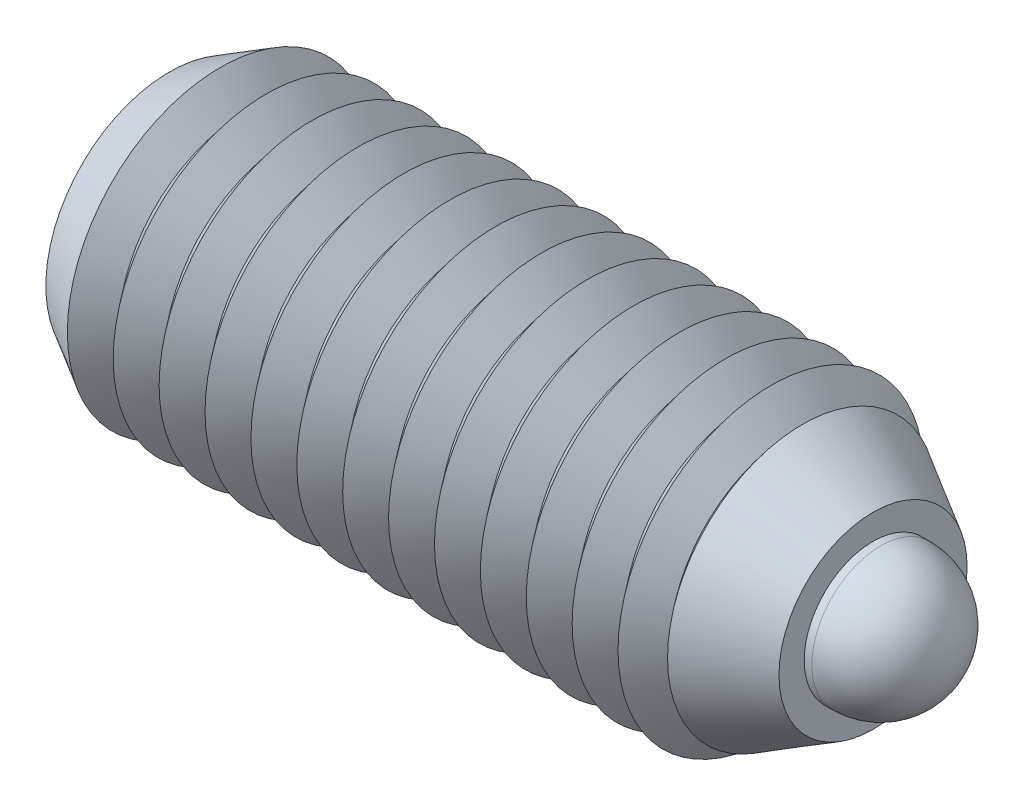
ISO-10303-21;
HEADER;
FILE_DESCRIPTION(('STEP AP214'),'2;1');
FILE_NAME('part.step','',(''),(''),'','','');
FILE_SCHEMA(('AUTOMOTIVE_DESIGN { 1 0 10303 214 1 1 1 1 }'));
ENDSEC;
DATA;
#1=APPLICATION_CONTEXT('core data for automotive mechanical design processes');
#2=APPLICATION_PROTOCOL_DEFINITION('international standard','automotive_design',2000,#1);
#3=PRODUCT_CONTEXT('',#1,'mechanical');
#4=PRODUCT('Part','Part','',(#3));
#5=PRODUCT_RELATED_PRODUCT_CATEGORY('part','',(#4));
#6=PRODUCT_DEFINITION_FORMATION('','',#4);
#7=PRODUCT_DEFINITION_CONTEXT('part definition',#1,'design');
#8=PRODUCT_DEFINITION('design','',#6,#7);
#9=PRODUCT_DEFINITION_SHAPE('','',#8);
#10=(LENGTH_UNIT() NAMED_UNIT(*) SI_UNIT(.MILLI.,.METRE.));
#11=(NAMED_UNIT(*) PLANE_ANGLE_UNIT() SI_UNIT($,.RADIAN.));
#12=(NAMED_UNIT(*) SI_UNIT($,.STERADIAN.) SOLID_ANGLE_UNIT());
#13=UNCERTAINTY_MEASURE_WITH_UNIT(LENGTH_MEASURE(1.E-05),#10,'distance_accuracy_value','');
#14=(GEOMETRIC_REPRESENTATION_CONTEXT(3) GLOBAL_UNCERTAINTY_ASSIGNED_CONTEXT((#13)) GLOBAL_UNIT_ASSIGNED_CONTEXT((#10,
#11,#12)) REPRESENTATION_CONTEXT('',''));
#15=CARTESIAN_POINT('',(0.,0.,0.));
#16=DIRECTION('',(0.,0.,1.));
#17=DIRECTION('',(1.,0.,0.));
#18=AXIS2_PLACEMENT_3D('',#15,#16,#17);
#19=CARTESIAN_POINT('',(21.45,0.,0.));
#20=DIRECTION('',(-1.,0.,0.));
#21=DIRECTION('',(0.,0.,1.));
#22=AXIS2_PLACEMENT_3D('',#19,#20,#21);
#23=CYLINDRICAL_SURFACE('',#22,3.15);
#24=CARTESIAN_POINT('',(17.77,0.,0.));
#25=DIRECTION('',(1.,0.,0.));
#26=DIRECTION('',(0.,0.,-1.));
#27=AXIS2_PLACEMENT_3D('',#24,#25,#26);
#28=CIRCLE('',#27,3.15);
#29=CARTESIAN_POINT('',(17.77,0.,3.15));
#30=VERTEX_POINT('',#29);
#31=EDGE_CURVE('P0_E21',#30,#30,#28,.T.);
#32=CARTESIAN_POINT('',(20.55,0.,0.));
#33=DIRECTION('',(1.,0.,0.));
#34=DIRECTION('',(0.,0.,-1.));
#35=AXIS2_PLACEMENT_3D('',#32,#33,#34);
#36=CIRCLE('',#35,3.15);
#37=CARTESIAN_POINT('',(20.55,0.,3.15));
#38=VERTEX_POINT('',#37);
#39=EDGE_CURVE('P0_E25',#38,#38,#36,.F.);
#40=CARTESIAN_POINT('',(17.77,0.,3.15));
#41=CARTESIAN_POINT('',(17.7989583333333,0.,3.15));
#42=CARTESIAN_POINT('',(17.8279166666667,0.,3.15));
#43=CARTESIAN_POINT('',(17.8858333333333,0.,3.15));
#44=CARTESIAN_POINT('',(17.9147916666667,0.,3.15));
#45=CARTESIAN_POINT('',(17.9727083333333,0.,3.15));
#46=CARTESIAN_POINT('',(18.0016666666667,0.,3.15));
#47=CARTESIAN_POINT('',(18.0595833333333,0.,3.15));
#48=CARTESIAN_POINT('',(18.0885416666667,0.,3.15));
#49=CARTESIAN_POINT('',(18.1464583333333,0.,3.15));
#50=CARTESIAN_POINT('',(18.1754166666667,0.,3.15));
#51=CARTESIAN_POINT('',(18.2333333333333,0.,3.15));
#52=CARTESIAN_POINT('',(18.2622916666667,0.,3.15));
#53=CARTESIAN_POINT('',(18.3202083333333,0.,3.15));
#54=CARTESIAN_POINT('',(18.3491666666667,0.,3.15));
#55=CARTESIAN_POINT('',(18.4070833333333,0.,3.15));
#56=CARTESIAN_POINT('',(18.4360416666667,0.,3.15));
#57=CARTESIAN_POINT('',(18.4939583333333,0.,3.15));
#58=CARTESIAN_POINT('',(18.5229166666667,0.,3.15));
#59=CARTESIAN_POINT('',(18.5808333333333,0.,3.15));
#60=CARTESIAN_POINT('',(18.6097916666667,0.,3.15));
#61=CARTESIAN_POINT('',(18.6677083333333,0.,3.15));
#62=CARTESIAN_POINT('',(18.6966666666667,0.,3.15));
#63=CARTESIAN_POINT('',(18.7545833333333,0.,3.15));
#64=CARTESIAN_POINT('',(18.7835416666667,0.,3.15));
#65=CARTESIAN_POINT('',(18.8414583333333,0.,3.15));
#66=CARTESIAN_POINT('',(18.8704166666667,0.,3.15));
#67=CARTESIAN_POINT('',(18.9283333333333,0.,3.15));
#68=CARTESIAN_POINT('',(18.9572916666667,0.,3.15));
#69=CARTESIAN_POINT('',(19.0152083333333,0.,3.15));
#70=CARTESIAN_POINT('',(19.0441666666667,0.,3.15));
#71=CARTESIAN_POINT('',(19.1020833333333,0.,3.15));
#72=CARTESIAN_POINT('',(19.1310416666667,0.,3.15));
#73=CARTESIAN_POINT('',(19.1889583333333,0.,3.15));
#74=CARTESIAN_POINT('',(19.2179166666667,0.,3.15));
#75=CARTESIAN_POINT('',(19.2758333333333,0.,3.15));
#76=CARTESIAN_POINT('',(19.3047916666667,0.,3.15));
#77=CARTESIAN_POINT('',(19.3627083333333,0.,3.15));
#78=CARTESIAN_POINT('',(19.3916666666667,0.,3.15));
#79=CARTESIAN_POINT('',(19.4495833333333,0.,3.15));
#80=CARTESIAN_POINT('',(19.4785416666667,0.,3.15));
#81=CARTESIAN_POINT('',(19.5364583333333,0.,3.15));
#82=CARTESIAN_POINT('',(19.5654166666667,0.,3.15));
#83=CARTESIAN_POINT('',(19.6233333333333,0.,3.15));
#84=CARTESIAN_POINT('',(19.6522916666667,0.,3.15));
#85=CARTESIAN_POINT('',(19.7102083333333,0.,3.15));
#86=CARTESIAN_POINT('',(19.7391666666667,0.,3.15));
#87=CARTESIAN_POINT('',(19.7970833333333,0.,3.15));
#88=CARTESIAN_POINT('',(19.8260416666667,0.,3.15));
#89=CARTESIAN_POINT('',(19.8839583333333,0.,3.15));
#90=CARTESIAN_POINT('',(19.9129166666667,0.,3.15));
#91=CARTESIAN_POINT('',(19.9708333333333,0.,3.15));
#92=CARTESIAN_POINT('',(19.9997916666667,0.,3.15));
#93=CARTESIAN_POINT('',(20.0577083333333,0.,3.15));
#94=CARTESIAN_POINT('',(20.0866666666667,0.,3.15));
#95=CARTESIAN_POINT('',(20.1445833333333,0.,3.15));
#96=CARTESIAN_POINT('',(20.1735416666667,0.,3.15));
#97=CARTESIAN_POINT('',(20.2314583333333,0.,3.15));
#98=CARTESIAN_POINT('',(20.2604166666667,0.,3.15));
#99=CARTESIAN_POINT('',(20.3183333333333,0.,3.15));
#100=CARTESIAN_POINT('',(20.3472916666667,0.,3.15));
#101=CARTESIAN_POINT('',(20.4052083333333,0.,3.15));
#102=CARTESIAN_POINT('',(20.4341666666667,0.,3.15));
#103=CARTESIAN_POINT('',(20.4920833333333,0.,3.15));
#104=CARTESIAN_POINT('',(20.5210416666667,0.,3.15));
#105=CARTESIAN_POINT('',(20.55,0.,3.15));
#106=B_SPLINE_CURVE_WITH_KNOTS('',3,(#40,#41,#42,#43,#44,#45,#46,#47,#48,#49,#50,#51,#52,#53,
#54,#55,#56,#57,#58,#59,#60,#61,#62,#63,#64,#65,#66,#67,#68,#69,#70,#71,#72,#73,#74,#75,#76,#77,
#78,#79,#80,#81,#82,#83,#84,#85,#86,#87,#88,#89,#90,#91,#92,#93,#94,#95,#96,#97,#98,#99,#100,
#101,#102,#103,#104,#105),.UNSPECIFIED.,.F.,.F.,(4,2,2,2,2,2,2,2,2,2,2,2,2,2,2,2,2,2,2,2,2,2,2,
2,2,2,2,2,2,2,2,2,4),(0.,0.0868750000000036,0.173750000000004,0.260625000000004,
0.347500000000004,0.434375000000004,0.521250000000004,0.608125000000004,0.695000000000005,
0.781875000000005,0.868750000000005,0.955625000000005,1.04250000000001,1.12937500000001,
1.21625000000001,1.30312500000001,1.39000000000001,1.47687500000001,1.56375000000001,
1.65062500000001,1.73750000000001,1.82437500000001,1.91125000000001,1.99812500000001,
2.08500000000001,2.17187500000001,2.25875000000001,2.34562500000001,2.43250000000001,
2.51937500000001,2.60625000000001,2.69312500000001,2.78000000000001),.UNSPECIFIED.);
#107=EDGE_CURVE('P0_BSEAM14',#30,#38,#106,.T.);
#108=ORIENTED_EDGE('',*,*,#31,.T.);
#109=ORIENTED_EDGE('',*,*,#39,.T.);
#110=ORIENTED_EDGE('',*,*,#107,.T.);
#111=ORIENTED_EDGE('',*,*,#107,.F.);
#112=EDGE_LOOP('',(#108,#110,#109,#111));
#113=FACE_BOUND('',#112,.T.);
#114=ADVANCED_FACE('P0_F14',(#113),#23,.T.);
#115=CARTESIAN_POINT('',(16.85,0.,0.));
#116=DIRECTION('',(1.,0.,0.));
#117=DIRECTION('',(0.,0.,-1.));
#118=AXIS2_PLACEMENT_3D('',#115,#116,#117);
#119=PLANE('',#118);
#120=CARTESIAN_POINT('',(16.85,0.,0.));
#121=DIRECTION('',(1.,0.,0.));
#122=DIRECTION('',(0.,0.,-1.));
#123=AXIS2_PLACEMENT_3D('',#120,#121,#122);
#124=CIRCLE('',#123,2.90348674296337);
#125=CARTESIAN_POINT('',(16.85,0.,-2.90348674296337));
#126=VERTEX_POINT('',#125);
#127=EDGE_CURVE('P0_E10',#126,#126,#124,.F.);
#128=ORIENTED_EDGE('',*,*,#127,.T.);
#129=EDGE_LOOP('',(#128));
#130=FACE_BOUND('',#129,.T.);
#131=ADVANCED_FACE('P0_F43',(#130),#119,.F.);
#132=CARTESIAN_POINT('',(23.25,0.,0.));
#133=DIRECTION('',(-1.,0.,0.));
#134=DIRECTION('',(0.,0.,1.));
#135=AXIS2_PLACEMENT_3D('',#132,#133,#134);
#136=CYLINDRICAL_SURFACE('',#135,2.25);
#137=CARTESIAN_POINT('',(23.25,0.,0.));
#138=DIRECTION('',(1.,0.,0.));
#139=DIRECTION('',(0.,0.,-1.));
#140=AXIS2_PLACEMENT_3D('',#137,#138,#139);
#141=CIRCLE('',#140,2.25);
#142=CARTESIAN_POINT('',(23.25,0.,-2.25));
#143=VERTEX_POINT('',#142);
#144=EDGE_CURVE('P0_E29',#143,#143,#141,.T.);
#145=ORIENTED_EDGE('',*,*,#144,.F.);
#146=EDGE_LOOP('',(#145));
#147=FACE_BOUND('',#146,.T.);
#148=CARTESIAN_POINT('',(21.45,0.,0.));
#149=DIRECTION('',(1.,0.,0.));
#150=DIRECTION('',(0.,0.,-1.));
#151=AXIS2_PLACEMENT_3D('',#148,#149,#150);
#152=CIRCLE('',#151,2.25);
#153=CARTESIAN_POINT('',(21.45,0.,-2.25));
#154=VERTEX_POINT('',#153);
#155=EDGE_CURVE('P0_E32',#154,#154,#152,.T.);
#156=ORIENTED_EDGE('',*,*,#155,.T.);
#157=EDGE_LOOP('',(#156));
#158=FACE_BOUND('',#157,.T.);
#159=ADVANCED_FACE('P0_F40',(#147,#158),#136,.T.);
#160=CARTESIAN_POINT('',(23.25,0.,0.));
#161=DIRECTION('',(-1.,0.,0.));
#162=DIRECTION('',(0.,1.,0.));
#163=AXIS2_PLACEMENT_3D('',#160,#161,#162);
#164=SPHERICAL_SURFACE('',#163,2.25);
#165=ORIENTED_EDGE('',*,*,#144,.T.);
#166=EDGE_LOOP('',(#165));
#167=FACE_BOUND('',#166,.T.);
#168=ADVANCED_FACE('P0_F38',(#167),#164,.T.);
#169=CARTESIAN_POINT('',(21.45,0.,0.));
#170=DIRECTION('',(-1.,0.,0.));
#171=DIRECTION('',(0.,0.,1.));
#172=AXIS2_PLACEMENT_3D('',#169,#170,#171);
#173=CONICAL_SURFACE('',#172,2.25000000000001,0.785398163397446);
#174=ORIENTED_EDGE('',*,*,#39,.F.);
#175=EDGE_LOOP('',(#174));
#176=FACE_BOUND('',#175,.T.);
#177=ORIENTED_EDGE('',*,*,#155,.F.);
#178=EDGE_LOOP('',(#177));
#179=FACE_BOUND('',#178,.T.);
#180=ADVANCED_FACE('P0_F47',(#176,#179),#173,.T.);
#181=CARTESIAN_POINT('',(17.77,0.,0.));
#182=DIRECTION('',(1.,0.,0.));
#183=DIRECTION('',(0.,0.,-1.));
#184=AXIS2_PLACEMENT_3D('',#181,#182,#183);
#185=CONICAL_SURFACE('',#184,3.15,0.261799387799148);
#186=ORIENTED_EDGE('',*,*,#127,.F.);
#187=EDGE_LOOP('',(#186));
#188=FACE_BOUND('',#187,.T.);
#189=ORIENTED_EDGE('',*,*,#31,.F.);
#190=EDGE_LOOP('',(#189));
#191=FACE_BOUND('',#190,.T.);
#192=ADVANCED_FACE('P0_F16',(#188,#191),#185,.T.);
#193=CLOSED_SHELL('',(#114,#131,#159,#168,#180,#192));
#194=MANIFOLD_SOLID_BREP('P0_B1',#193);
#195=CARTESIAN_POINT('',(23.,0.,0.));
#196=DIRECTION('',(-1.,0.,0.));
#197=DIRECTION('',(0.,0.,1.));
#198=AXIS2_PLACEMENT_3D('',#195,#196,#197);
#199=CONICAL_SURFACE('',#198,3.07499999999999,0.5235987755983);
#200=CARTESIAN_POINT('',(23.,0.,0.));
#201=DIRECTION('',(1.,0.,0.));
#202=DIRECTION('',(0.,0.,-1.));
#203=AXIS2_PLACEMENT_3D('',#200,#201,#202);
#204=CIRCLE('',#203,3.07499999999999);
#205=CARTESIAN_POINT('',(23.,0.,-3.07499999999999));
#206=VERTEX_POINT('',#205);
#207=EDGE_CURVE('P1_E326',#206,#206,#204,.T.);
#208=ORIENTED_EDGE('',*,*,#207,.F.);
#209=EDGE_LOOP('',(#208));
#210=FACE_BOUND('',#209,.T.);
#211=CARTESIAN_POINT('',(20.6916184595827,0.,0.));
#212=DIRECTION('',(1.,0.,0.));
#213=DIRECTION('',(0.,0.,-1.));
#214=AXIS2_PLACEMENT_3D('',#211,#212,#213);
#215=CIRCLE('',#214,4.40774470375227);
#216=CARTESIAN_POINT('',(20.6916184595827,0.,-4.40774470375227));
#217=VERTEX_POINT('',#216);
#218=EDGE_CURVE('P1_E330',#217,#217,#215,.T.);
#219=ORIENTED_EDGE('',*,*,#218,.T.);
#220=EDGE_LOOP('',(#219));
#221=FACE_BOUND('',#220,.T.);
#222=ADVANCED_FACE('P1_F15',(#210,#221),#199,.T.);
#223=CARTESIAN_POINT('',(23.,0.,0.));
#224=DIRECTION('',(1.,0.,0.));
#225=DIRECTION('',(0.,0.,-1.));
#226=AXIS2_PLACEMENT_3D('',#223,#224,#225);
#227=PLANE('',#226);
#228=ORIENTED_EDGE('',*,*,#207,.T.);
#229=EDGE_LOOP('',(#228));
#230=FACE_BOUND('',#229,.T.);
#231=CARTESIAN_POINT('',(23.,0.,0.));
#232=DIRECTION('',(1.,0.,0.));
#233=DIRECTION('',(0.,0.,-1.));
#234=AXIS2_PLACEMENT_3D('',#231,#232,#233);
#235=CIRCLE('',#234,2.25);
#236=CARTESIAN_POINT('',(23.,0.,-2.25));
#237=VERTEX_POINT('',#236);
#238=EDGE_CURVE('P1_E333',#237,#237,#235,.T.);
#239=ORIENTED_EDGE('',*,*,#238,.F.);
#240=EDGE_LOOP('',(#239));
#241=FACE_BOUND('',#240,.T.);
#242=ADVANCED_FACE('P1_F188',(#230,#241),#227,.T.);
#243=CARTESIAN_POINT('',(6.9,0.,0.));
#244=DIRECTION('',(-1.,0.,0.));
#245=DIRECTION('',(0.,0.,1.));
#246=AXIS2_PLACEMENT_3D('',#243,#244,#245);
#247=PLANE('',#246);
#248=CARTESIAN_POINT('',(6.9,0.,0.));
#249=DIRECTION('',(1.,0.,0.));
#250=DIRECTION('',(0.,0.,-1.));
#251=AXIS2_PLACEMENT_3D('',#248,#249,#250);
#252=CIRCLE('',#251,3.15);
#253=CARTESIAN_POINT('',(6.9,0.,-3.15));
#254=VERTEX_POINT('',#253);
#255=EDGE_CURVE('P1_E416',#254,#254,#252,.T.);
#256=ORIENTED_EDGE('',*,*,#255,.T.);
#257=EDGE_LOOP('',(#256));
#258=FACE_BOUND('',#257,.T.);
#259=ADVANCED_FACE('P1_F194',(#258),#247,.F.);
#260=CARTESIAN_POINT('',(23.,0.,0.));
#261=DIRECTION('',(1.,0.,0.));
#262=DIRECTION('',(0.,0.,-1.));
#263=AXIS2_PLACEMENT_3D('',#260,#261,#262);
#264=CYLINDRICAL_SURFACE('',#263,3.15);
#265=ORIENTED_EDGE('',*,*,#255,.F.);
#266=EDGE_LOOP('',(#265));
#267=FACE_BOUND('',#266,.T.);
#268=CARTESIAN_POINT('',(20.7,0.,0.));
#269=DIRECTION('',(1.,0.,0.));
#270=DIRECTION('',(0.,0.,-1.));
#271=AXIS2_PLACEMENT_3D('',#268,#269,#270);
#272=CIRCLE('',#271,3.15);
#273=CARTESIAN_POINT('',(20.7,0.,-3.15));
#274=VERTEX_POINT('',#273);
#275=EDGE_CURVE('P1_E414',#274,#274,#272,.T.);
#276=ORIENTED_EDGE('',*,*,#275,.T.);
#277=EDGE_LOOP('',(#276));
#278=FACE_BOUND('',#277,.T.);
#279=ADVANCED_FACE('P1_F683',(#267,#278),#264,.F.);
#280=CARTESIAN_POINT('',(23.,0.,0.));
#281=DIRECTION('',(-1.,0.,0.));
#282=DIRECTION('',(0.,0.,1.));
#283=AXIS2_PLACEMENT_3D('',#280,#281,#282);
#284=CONICAL_SURFACE('',#283,2.25,0.37298772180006);
#285=ORIENTED_EDGE('',*,*,#275,.F.);
#286=EDGE_LOOP('',(#285));
#287=FACE_BOUND('',#286,.T.);
#288=ORIENTED_EDGE('',*,*,#238,.T.);
#289=EDGE_LOOP('',(#288));
#290=FACE_BOUND('',#289,.T.);
#291=ADVANCED_FACE('P1_F675',(#287,#290),#284,.F.);
#292=CARTESIAN_POINT('',(20.4158021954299,0.,0.));
#293=DIRECTION('',(1.,0.,0.));
#294=DIRECTION('',(0.,0.,-1.));
#295=AXIS2_PLACEMENT_3D('',#292,#293,#294);
#296=CONICAL_SURFACE('',#295,4.06325030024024,0.895664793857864);
#297=ORIENTED_EDGE('',*,*,#218,.F.);
#298=EDGE_LOOP('',(#297));
#299=FACE_BOUND('',#298,.T.);
#300=CARTESIAN_POINT('',(20.4158021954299,0.,0.));
#301=DIRECTION('',(-1.,0.,0.));
#302=DIRECTION('',(0.,0.,1.));
#303=AXIS2_PLACEMENT_3D('',#300,#301,#302);
#304=CIRCLE('',#303,4.06325030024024);
#305=CARTESIAN_POINT('',(20.4158021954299,0.,4.06325030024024));
#306=VERTEX_POINT('',#305);
#307=EDGE_CURVE('P1_E334',#306,#306,#304,.T.);
#308=ORIENTED_EDGE('',*,*,#307,.F.);
#309=EDGE_LOOP('',(#308));
#310=FACE_BOUND('',#309,.T.);
#311=ADVANCED_FACE('P1_F667',(#299,#310),#296,.T.);
#312=CARTESIAN_POINT('',(19.6658021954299,0.,0.));
#313=DIRECTION('',(-1.,0.,0.));
#314=DIRECTION('',(0.,0.,1.));
#315=AXIS2_PLACEMENT_3D('',#312,#313,#314);
#316=CONICAL_SURFACE('',#315,5.,0.895664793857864);
#317=ORIENTED_EDGE('',*,*,#307,.T.);
#318=EDGE_LOOP('',(#317));
#319=FACE_BOUND('',#318,.T.);
#320=CARTESIAN_POINT('',(19.6658021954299,0.,0.));
#321=DIRECTION('',(-1.,0.,0.));
#322=DIRECTION('',(0.,0.,1.));
#323=AXIS2_PLACEMENT_3D('',#320,#321,#322);
#324=CIRCLE('',#323,5.);
#325=CARTESIAN_POINT('',(19.6658021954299,0.,5.));
#326=VERTEX_POINT('',#325);
#327=EDGE_CURVE('P1_E407',#326,#326,#324,.T.);
#328=ORIENTED_EDGE('',*,*,#327,.F.);
#329=EDGE_LOOP('',(#328));
#330=FACE_BOUND('',#329,.T.);
#331=ADVANCED_FACE('P1_F659',(#319,#330),#316,.T.);
#332=CARTESIAN_POINT('',(18.9158021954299,0.,0.));
#333=DIRECTION('',(1.,0.,0.));
#334=DIRECTION('',(0.,0.,-1.));
#335=AXIS2_PLACEMENT_3D('',#332,#333,#334);
#336=CONICAL_SURFACE('',#335,4.06325030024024,0.895664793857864);
#337=ORIENTED_EDGE('',*,*,#327,.T.);
#338=EDGE_LOOP('',(#337));
#339=FACE_BOUND('',#338,.T.);
#340=CARTESIAN_POINT('',(18.9158021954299,0.,0.));
#341=DIRECTION('',(-1.,0.,0.));
#342=DIRECTION('',(0.,0.,1.));
#343=AXIS2_PLACEMENT_3D('',#340,#341,#342);
#344=CIRCLE('',#343,4.06325030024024);
#345=CARTESIAN_POINT('',(18.9158021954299,0.,4.06325030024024));
#346=VERTEX_POINT('',#345);
#347=EDGE_CURVE('P1_E404',#346,#346,#344,.T.);
#348=ORIENTED_EDGE('',*,*,#347,.F.);
#349=EDGE_LOOP('',(#348));
#350=FACE_BOUND('',#349,.T.);
#351=ADVANCED_FACE('P1_F651',(#339,#350),#336,.T.);
#352=CARTESIAN_POINT('',(18.1658021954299,0.,0.));
#353=DIRECTION('',(-1.,0.,0.));
#354=DIRECTION('',(0.,0.,1.));
#355=AXIS2_PLACEMENT_3D('',#352,#353,#354);
#356=CONICAL_SURFACE('',#355,5.,0.895664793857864);
#357=ORIENTED_EDGE('',*,*,#347,.T.);
#358=EDGE_LOOP('',(#357));
#359=FACE_BOUND('',#358,.T.);
#360=CARTESIAN_POINT('',(18.1658021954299,0.,0.));
#361=DIRECTION('',(-1.,0.,0.));
#362=DIRECTION('',(0.,0.,1.));
#363=AXIS2_PLACEMENT_3D('',#360,#361,#362);
#364=CIRCLE('',#363,5.);
#365=CARTESIAN_POINT('',(18.1658021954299,0.,5.));
#366=VERTEX_POINT('',#365);
#367=EDGE_CURVE('P1_E401',#366,#366,#364,.T.);
#368=ORIENTED_EDGE('',*,*,#367,.F.);
#369=EDGE_LOOP('',(#368));
#370=FACE_BOUND('',#369,.T.);
#371=ADVANCED_FACE('P1_F643',(#359,#370),#356,.T.);
#372=CARTESIAN_POINT('',(17.4158021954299,0.,0.));
#373=DIRECTION('',(1.,0.,0.));
#374=DIRECTION('',(0.,0.,-1.));
#375=AXIS2_PLACEMENT_3D('',#372,#373,#374);
#376=CONICAL_SURFACE('',#375,4.06325030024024,0.895664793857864);
#377=ORIENTED_EDGE('',*,*,#367,.T.);
#378=EDGE_LOOP('',(#377));
#379=FACE_BOUND('',#378,.T.);
#380=CARTESIAN_POINT('',(17.4158021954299,0.,0.));
#381=DIRECTION('',(-1.,0.,0.));
#382=DIRECTION('',(0.,0.,1.));
#383=AXIS2_PLACEMENT_3D('',#380,#381,#382);
#384=CIRCLE('',#383,4.06325030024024);
#385=CARTESIAN_POINT('',(17.4158021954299,0.,4.06325030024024));
#386=VERTEX_POINT('',#385);
#387=EDGE_CURVE('P1_E398',#386,#386,#384,.T.);
#388=ORIENTED_EDGE('',*,*,#387,.F.);
#389=EDGE_LOOP('',(#388));
#390=FACE_BOUND('',#389,.T.);
#391=ADVANCED_FACE('P1_F635',(#379,#390),#376,.T.);
#392=CARTESIAN_POINT('',(16.6658021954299,0.,0.));
#393=DIRECTION('',(-1.,0.,0.));
#394=DIRECTION('',(0.,0.,1.));
#395=AXIS2_PLACEMENT_3D('',#392,#393,#394);
#396=CONICAL_SURFACE('',#395,5.,0.895664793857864);
#397=ORIENTED_EDGE('',*,*,#387,.T.);
#398=EDGE_LOOP('',(#397));
#399=FACE_BOUND('',#398,.T.);
#400=CARTESIAN_POINT('',(16.6658021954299,0.,0.));
#401=DIRECTION('',(-1.,0.,0.));
#402=DIRECTION('',(0.,0.,1.));
#403=AXIS2_PLACEMENT_3D('',#400,#401,#402);
#404=CIRCLE('',#403,5.);
#405=CARTESIAN_POINT('',(16.6658021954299,0.,5.));
#406=VERTEX_POINT('',#405);
#407=EDGE_CURVE('P1_E395',#406,#406,#404,.T.);
#408=ORIENTED_EDGE('',*,*,#407,.F.);
#409=EDGE_LOOP('',(#408));
#410=FACE_BOUND('',#409,.T.);
#411=ADVANCED_FACE('P1_F627',(#399,#410),#396,.T.);
#412=CARTESIAN_POINT('',(15.9158021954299,0.,0.));
#413=DIRECTION('',(1.,0.,0.));
#414=DIRECTION('',(0.,0.,-1.));
#415=AXIS2_PLACEMENT_3D('',#412,#413,#414);
#416=CONICAL_SURFACE('',#415,4.06325030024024,0.895664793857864);
#417=ORIENTED_EDGE('',*,*,#407,.T.);
#418=EDGE_LOOP('',(#417));
#419=FACE_BOUND('',#418,.T.);
#420=CARTESIAN_POINT('',(15.9158021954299,0.,0.));
#421=DIRECTION('',(-1.,0.,0.));
#422=DIRECTION('',(0.,0.,1.));
#423=AXIS2_PLACEMENT_3D('',#420,#421,#422);
#424=CIRCLE('',#423,4.06325030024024);
#425=CARTESIAN_POINT('',(15.9158021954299,0.,4.06325030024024));
#426=VERTEX_POINT('',#425);
#427=EDGE_CURVE('P1_E392',#426,#426,#424,.T.);
#428=ORIENTED_EDGE('',*,*,#427,.F.);
#429=EDGE_LOOP('',(#428));
#430=FACE_BOUND('',#429,.T.);
#431=ADVANCED_FACE('P1_F619',(#419,#430),#416,.T.);
#432=CARTESIAN_POINT('',(15.1658021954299,0.,0.));
#433=DIRECTION('',(-1.,0.,0.));
#434=DIRECTION('',(0.,0.,1.));
#435=AXIS2_PLACEMENT_3D('',#432,#433,#434);
#436=CONICAL_SURFACE('',#435,5.,0.895664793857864);
#437=ORIENTED_EDGE('',*,*,#427,.T.);
#438=EDGE_LOOP('',(#437));
#439=FACE_BOUND('',#438,.T.);
#440=CARTESIAN_POINT('',(15.1658021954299,0.,0.));
#441=DIRECTION('',(-1.,0.,0.));
#442=DIRECTION('',(0.,0.,1.));
#443=AXIS2_PLACEMENT_3D('',#440,#441,#442);
#444=CIRCLE('',#443,5.);
#445=CARTESIAN_POINT('',(15.1658021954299,0.,5.));
#446=VERTEX_POINT('',#445);
#447=EDGE_CURVE('P1_E389',#446,#446,#444,.T.);
#448=ORIENTED_EDGE('',*,*,#447,.F.);
#449=EDGE_LOOP('',(#448));
#450=FACE_BOUND('',#449,.T.);
#451=ADVANCED_FACE('P1_F611',(#439,#450),#436,.T.);
#452=CARTESIAN_POINT('',(14.4158021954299,0.,0.));
#453=DIRECTION('',(1.,0.,0.));
#454=DIRECTION('',(0.,0.,-1.));
#455=AXIS2_PLACEMENT_3D('',#452,#453,#454);
#456=CONICAL_SURFACE('',#455,4.06325030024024,0.895664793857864);
#457=ORIENTED_EDGE('',*,*,#447,.T.);
#458=EDGE_LOOP('',(#457));
#459=FACE_BOUND('',#458,.T.);
#460=CARTESIAN_POINT('',(14.4158021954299,0.,0.));
#461=DIRECTION('',(-1.,0.,0.));
#462=DIRECTION('',(0.,0.,1.));
#463=AXIS2_PLACEMENT_3D('',#460,#461,#462);
#464=CIRCLE('',#463,4.06325030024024);
#465=CARTESIAN_POINT('',(14.4158021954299,0.,4.06325030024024));
#466=VERTEX_POINT('',#465);
#467=EDGE_CURVE('P1_E386',#466,#466,#464,.T.);
#468=ORIENTED_EDGE('',*,*,#467,.F.);
#469=EDGE_LOOP('',(#468));
#470=FACE_BOUND('',#469,.T.);
#471=ADVANCED_FACE('P1_F602',(#459,#470),#456,.T.);
#472=CARTESIAN_POINT('',(13.6658021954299,0.,0.));
#473=DIRECTION('',(-1.,0.,0.));
#474=DIRECTION('',(0.,0.,1.));
#475=AXIS2_PLACEMENT_3D('',#472,#473,#474);
#476=CONICAL_SURFACE('',#475,5.,0.895664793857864);
#477=ORIENTED_EDGE('',*,*,#467,.T.);
#478=EDGE_LOOP('',(#477));
#479=FACE_BOUND('',#478,.T.);
#480=CARTESIAN_POINT('',(13.6658021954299,0.,0.));
#481=DIRECTION('',(-1.,0.,0.));
#482=DIRECTION('',(0.,0.,1.));
#483=AXIS2_PLACEMENT_3D('',#480,#481,#482);
#484=CIRCLE('',#483,5.);
#485=CARTESIAN_POINT('',(13.6658021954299,0.,5.));
#486=VERTEX_POINT('',#485);
#487=EDGE_CURVE('P1_E383',#486,#486,#484,.T.);
#488=ORIENTED_EDGE('',*,*,#487,.F.);
#489=EDGE_LOOP('',(#488));
#490=FACE_BOUND('',#489,.T.);
#491=ADVANCED_FACE('P1_F594',(#479,#490),#476,.T.);
#492=CARTESIAN_POINT('',(12.9158021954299,0.,0.));
#493=DIRECTION('',(1.,0.,0.));
#494=DIRECTION('',(0.,0.,-1.));
#495=AXIS2_PLACEMENT_3D('',#492,#493,#494);
#496=CONICAL_SURFACE('',#495,4.06325030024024,0.895664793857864);
#497=ORIENTED_EDGE('',*,*,#487,.T.);
#498=EDGE_LOOP('',(#497));
#499=FACE_BOUND('',#498,.T.);
#500=CARTESIAN_POINT('',(12.9158021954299,0.,0.));
#501=DIRECTION('',(-1.,0.,0.));
#502=DIRECTION('',(0.,0.,1.));
#503=AXIS2_PLACEMENT_3D('',#500,#501,#502);
#504=CIRCLE('',#503,4.06325030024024);
#505=CARTESIAN_POINT('',(12.9158021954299,0.,4.06325030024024));
#506=VERTEX_POINT('',#505);
#507=EDGE_CURVE('P1_E380',#506,#506,#504,.T.);
#508=ORIENTED_EDGE('',*,*,#507,.F.);
#509=EDGE_LOOP('',(#508));
#510=FACE_BOUND('',#509,.T.);
#511=ADVANCED_FACE('P1_F586',(#499,#510),#496,.T.);
#512=CARTESIAN_POINT('',(12.1658021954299,0.,0.));
#513=DIRECTION('',(-1.,0.,0.));
#514=DIRECTION('',(0.,0.,1.));
#515=AXIS2_PLACEMENT_3D('',#512,#513,#514);
#516=CONICAL_SURFACE('',#515,5.,0.895664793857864);
#517=ORIENTED_EDGE('',*,*,#507,.T.);
#518=EDGE_LOOP('',(#517));
#519=FACE_BOUND('',#518,.T.);
#520=CARTESIAN_POINT('',(12.1658021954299,0.,0.));
#521=DIRECTION('',(-1.,0.,0.));
#522=DIRECTION('',(0.,0.,1.));
#523=AXIS2_PLACEMENT_3D('',#520,#521,#522);
#524=CIRCLE('',#523,5.);
#525=CARTESIAN_POINT('',(12.1658021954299,0.,5.));
#526=VERTEX_POINT('',#525);
#527=EDGE_CURVE('P1_E377',#526,#526,#524,.T.);
#528=ORIENTED_EDGE('',*,*,#527,.F.);
#529=EDGE_LOOP('',(#528));
#530=FACE_BOUND('',#529,.T.);
#531=ADVANCED_FACE('P1_F578',(#519,#530),#516,.T.);
#532=CARTESIAN_POINT('',(11.4158021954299,0.,0.));
#533=DIRECTION('',(1.,0.,0.));
#534=DIRECTION('',(0.,0.,-1.));
#535=AXIS2_PLACEMENT_3D('',#532,#533,#534);
#536=CONICAL_SURFACE('',#535,4.06325030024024,0.895664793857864);
#537=ORIENTED_EDGE('',*,*,#527,.T.);
#538=EDGE_LOOP('',(#537));
#539=FACE_BOUND('',#538,.T.);
#540=CARTESIAN_POINT('',(11.4158021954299,0.,0.));
#541=DIRECTION('',(-1.,0.,0.));
#542=DIRECTION('',(0.,0.,1.));
#543=AXIS2_PLACEMENT_3D('',#540,#541,#542);
#544=CIRCLE('',#543,4.06325030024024);
#545=CARTESIAN_POINT('',(11.4158021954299,0.,4.06325030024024));
#546=VERTEX_POINT('',#545);
#547=EDGE_CURVE('P1_E374',#546,#546,#544,.T.);
#548=ORIENTED_EDGE('',*,*,#547,.F.);
#549=EDGE_LOOP('',(#548));
#550=FACE_BOUND('',#549,.T.);
#551=ADVANCED_FACE('P1_F570',(#539,#550),#536,.T.);
#552=CARTESIAN_POINT('',(10.6658021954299,0.,0.));
#553=DIRECTION('',(-1.,0.,0.));
#554=DIRECTION('',(0.,0.,1.));
#555=AXIS2_PLACEMENT_3D('',#552,#553,#554);
#556=CONICAL_SURFACE('',#555,5.,0.895664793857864);
#557=ORIENTED_EDGE('',*,*,#547,.T.);
#558=EDGE_LOOP('',(#557));
#559=FACE_BOUND('',#558,.T.);
#560=CARTESIAN_POINT('',(10.6658021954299,0.,0.));
#561=DIRECTION('',(-1.,0.,0.));
#562=DIRECTION('',(0.,0.,1.));
#563=AXIS2_PLACEMENT_3D('',#560,#561,#562);
#564=CIRCLE('',#563,5.);
#565=CARTESIAN_POINT('',(10.6658021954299,0.,5.));
#566=VERTEX_POINT('',#565);
#567=EDGE_CURVE('P1_E371',#566,#566,#564,.T.);
#568=ORIENTED_EDGE('',*,*,#567,.F.);
#569=EDGE_LOOP('',(#568));
#570=FACE_BOUND('',#569,.T.);
#571=ADVANCED_FACE('P1_F562',(#559,#570),#556,.T.);
#572=CARTESIAN_POINT('',(9.91580219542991,0.,0.));
#573=DIRECTION('',(1.,0.,0.));
#574=DIRECTION('',(0.,0.,-1.));
#575=AXIS2_PLACEMENT_3D('',#572,#573,#574);
#576=CONICAL_SURFACE('',#575,4.06325030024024,0.895664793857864);
#577=ORIENTED_EDGE('',*,*,#567,.T.);
#578=EDGE_LOOP('',(#577));
#579=FACE_BOUND('',#578,.T.);
#580=CARTESIAN_POINT('',(9.91580219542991,0.,0.));
#581=DIRECTION('',(-1.,0.,0.));
#582=DIRECTION('',(0.,0.,1.));
#583=AXIS2_PLACEMENT_3D('',#580,#581,#582);
#584=CIRCLE('',#583,4.06325030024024);
#585=CARTESIAN_POINT('',(9.91580219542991,0.,4.06325030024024));
#586=VERTEX_POINT('',#585);
#587=EDGE_CURVE('P1_E368',#586,#586,#584,.T.);
#588=ORIENTED_EDGE('',*,*,#587,.F.);
#589=EDGE_LOOP('',(#588));
#590=FACE_BOUND('',#589,.T.);
#591=ADVANCED_FACE('P1_F554',(#579,#590),#576,.T.);
#592=CARTESIAN_POINT('',(9.16580219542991,0.,0.));
#593=DIRECTION('',(-1.,0.,0.));
#594=DIRECTION('',(0.,0.,1.));
#595=AXIS2_PLACEMENT_3D('',#592,#593,#594);
#596=CONICAL_SURFACE('',#595,5.,0.895664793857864);
#597=ORIENTED_EDGE('',*,*,#587,.T.);
#598=EDGE_LOOP('',(#597));
#599=FACE_BOUND('',#598,.T.);
#600=CARTESIAN_POINT('',(9.16580219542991,0.,0.));
#601=DIRECTION('',(-1.,0.,0.));
#602=DIRECTION('',(0.,0.,1.));
#603=AXIS2_PLACEMENT_3D('',#600,#601,#602);
#604=CIRCLE('',#603,5.);
#605=CARTESIAN_POINT('',(9.16580219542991,0.,5.));
#606=VERTEX_POINT('',#605);
#607=EDGE_CURVE('P1_E365',#606,#606,#604,.T.);
#608=ORIENTED_EDGE('',*,*,#607,.F.);
#609=EDGE_LOOP('',(#608));
#610=FACE_BOUND('',#609,.T.);
#611=ADVANCED_FACE('P1_F546',(#599,#610),#596,.T.);
#612=CARTESIAN_POINT('',(8.41580219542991,0.,0.));
#613=DIRECTION('',(1.,0.,0.));
#614=DIRECTION('',(0.,0.,-1.));
#615=AXIS2_PLACEMENT_3D('',#612,#613,#614);
#616=CONICAL_SURFACE('',#615,4.06325030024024,0.895664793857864);
#617=ORIENTED_EDGE('',*,*,#607,.T.);
#618=EDGE_LOOP('',(#617));
#619=FACE_BOUND('',#618,.T.);
#620=CARTESIAN_POINT('',(8.41580219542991,0.,0.));
#621=DIRECTION('',(-1.,0.,0.));
#622=DIRECTION('',(0.,0.,1.));
#623=AXIS2_PLACEMENT_3D('',#620,#621,#622);
#624=CIRCLE('',#623,4.06325030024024);
#625=CARTESIAN_POINT('',(8.41580219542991,0.,4.06325030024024));
#626=VERTEX_POINT('',#625);
#627=EDGE_CURVE('P1_E362',#626,#626,#624,.T.);
#628=ORIENTED_EDGE('',*,*,#627,.F.);
#629=EDGE_LOOP('',(#628));
#630=FACE_BOUND('',#629,.T.);
#631=ADVANCED_FACE('P1_F538',(#619,#630),#616,.T.);
#632=CARTESIAN_POINT('',(7.66580219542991,0.,0.));
#633=DIRECTION('',(-1.,0.,0.));
#634=DIRECTION('',(0.,0.,1.));
#635=AXIS2_PLACEMENT_3D('',#632,#633,#634);
#636=CONICAL_SURFACE('',#635,5.,0.895664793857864);
#637=ORIENTED_EDGE('',*,*,#627,.T.);
#638=EDGE_LOOP('',(#637));
#639=FACE_BOUND('',#638,.T.);
#640=CARTESIAN_POINT('',(7.66580219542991,0.,0.));
#641=DIRECTION('',(-1.,0.,0.));
#642=DIRECTION('',(0.,0.,1.));
#643=AXIS2_PLACEMENT_3D('',#640,#641,#642);
#644=CIRCLE('',#643,5.);
#645=CARTESIAN_POINT('',(7.66580219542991,0.,5.));
#646=VERTEX_POINT('',#645);
#647=EDGE_CURVE('P1_E359',#646,#646,#644,.T.);
#648=ORIENTED_EDGE('',*,*,#647,.F.);
#649=EDGE_LOOP('',(#648));
#650=FACE_BOUND('',#649,.T.);
#651=ADVANCED_FACE('P1_F530',(#639,#650),#636,.T.);
#652=CARTESIAN_POINT('',(6.91580219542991,0.,0.));
#653=DIRECTION('',(1.,0.,0.));
#654=DIRECTION('',(0.,0.,-1.));
#655=AXIS2_PLACEMENT_3D('',#652,#653,#654);
#656=CONICAL_SURFACE('',#655,4.06325030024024,0.895664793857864);
#657=ORIENTED_EDGE('',*,*,#647,.T.);
#658=EDGE_LOOP('',(#657));
#659=FACE_BOUND('',#658,.T.);
#660=CARTESIAN_POINT('',(6.91580219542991,0.,0.));
#661=DIRECTION('',(-1.,0.,0.));
#662=DIRECTION('',(0.,0.,1.));
#663=AXIS2_PLACEMENT_3D('',#660,#661,#662);
#664=CIRCLE('',#663,4.06325030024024);
#665=CARTESIAN_POINT('',(6.91580219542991,0.,4.06325030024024));
#666=VERTEX_POINT('',#665);
#667=EDGE_CURVE('P1_E356',#666,#666,#664,.T.);
#668=ORIENTED_EDGE('',*,*,#667,.F.);
#669=EDGE_LOOP('',(#668));
#670=FACE_BOUND('',#669,.T.);
#671=ADVANCED_FACE('P1_F522',(#659,#670),#656,.T.);
#672=CARTESIAN_POINT('',(6.16580219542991,0.,0.));
#673=DIRECTION('',(-1.,0.,0.));
#674=DIRECTION('',(0.,0.,1.));
#675=AXIS2_PLACEMENT_3D('',#672,#673,#674);
#676=CONICAL_SURFACE('',#675,5.,0.895664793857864);
#677=ORIENTED_EDGE('',*,*,#667,.T.);
#678=EDGE_LOOP('',(#677));
#679=FACE_BOUND('',#678,.T.);
#680=CARTESIAN_POINT('',(6.16580219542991,0.,0.));
#681=DIRECTION('',(-1.,0.,0.));
#682=DIRECTION('',(0.,0.,1.));
#683=AXIS2_PLACEMENT_3D('',#680,#681,#682);
#684=CIRCLE('',#683,5.);
#685=CARTESIAN_POINT('',(6.16580219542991,0.,5.));
#686=VERTEX_POINT('',#685);
#687=EDGE_CURVE('P1_E353',#686,#686,#684,.T.);
#688=ORIENTED_EDGE('',*,*,#687,.F.);
#689=EDGE_LOOP('',(#688));
#690=FACE_BOUND('',#689,.T.);
#691=ADVANCED_FACE('P1_F514',(#679,#690),#676,.T.);
#692=CARTESIAN_POINT('',(5.41580219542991,0.,0.));
#693=DIRECTION('',(1.,0.,0.));
#694=DIRECTION('',(0.,0.,-1.));
#695=AXIS2_PLACEMENT_3D('',#692,#693,#694);
#696=CONICAL_SURFACE('',#695,4.06325030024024,0.895664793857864);
#697=ORIENTED_EDGE('',*,*,#687,.T.);
#698=EDGE_LOOP('',(#697));
#699=FACE_BOUND('',#698,.T.);
#700=CARTESIAN_POINT('',(5.41580219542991,0.,0.));
#701=DIRECTION('',(-1.,0.,0.));
#702=DIRECTION('',(0.,0.,1.));
#703=AXIS2_PLACEMENT_3D('',#700,#701,#702);
#704=CIRCLE('',#703,4.06325030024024);
#705=CARTESIAN_POINT('',(5.41580219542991,0.,4.06325030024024));
#706=VERTEX_POINT('',#705);
#707=EDGE_CURVE('P1_E350',#706,#706,#704,.T.);
#708=ORIENTED_EDGE('',*,*,#707,.F.);
#709=EDGE_LOOP('',(#708));
#710=FACE_BOUND('',#709,.T.);
#711=ADVANCED_FACE('P1_F506',(#699,#710),#696,.T.);
#712=CARTESIAN_POINT('',(4.66580219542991,0.,0.));
#713=DIRECTION('',(-1.,0.,0.));
#714=DIRECTION('',(0.,0.,1.));
#715=AXIS2_PLACEMENT_3D('',#712,#713,#714);
#716=CONICAL_SURFACE('',#715,5.,0.895664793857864);
#717=ORIENTED_EDGE('',*,*,#707,.T.);
#718=EDGE_LOOP('',(#717));
#719=FACE_BOUND('',#718,.T.);
#720=CARTESIAN_POINT('',(4.66580219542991,0.,0.));
#721=DIRECTION('',(-1.,0.,0.));
#722=DIRECTION('',(0.,0.,1.));
#723=AXIS2_PLACEMENT_3D('',#720,#721,#722);
#724=CIRCLE('',#723,5.);
#725=CARTESIAN_POINT('',(4.66580219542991,0.,5.));
#726=VERTEX_POINT('',#725);
#727=EDGE_CURVE('P1_E342',#726,#726,#724,.T.);
#728=ORIENTED_EDGE('',*,*,#727,.F.);
#729=EDGE_LOOP('',(#728));
#730=FACE_BOUND('',#729,.T.);
#731=ADVANCED_FACE('P1_F498',(#719,#730),#716,.T.);
#732=CARTESIAN_POINT('',(3.91580219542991,0.,0.));
#733=DIRECTION('',(1.,0.,0.));
#734=DIRECTION('',(0.,0.,-1.));
#735=AXIS2_PLACEMENT_3D('',#732,#733,#734);
#736=CONICAL_SURFACE('',#735,4.06325030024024,0.895664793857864);
#737=ORIENTED_EDGE('',*,*,#727,.T.);
#738=EDGE_LOOP('',(#737));
#739=FACE_BOUND('',#738,.T.);
#740=CARTESIAN_POINT('',(3.91580219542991,0.,0.));
#741=DIRECTION('',(-1.,0.,0.));
#742=DIRECTION('',(0.,0.,1.));
#743=AXIS2_PLACEMENT_3D('',#740,#741,#742);
#744=CIRCLE('',#743,4.06325030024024);
#745=CARTESIAN_POINT('',(3.91580219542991,0.,4.06325030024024));
#746=VERTEX_POINT('',#745);
#747=EDGE_CURVE('P1_E338',#746,#746,#744,.T.);
#748=ORIENTED_EDGE('',*,*,#747,.F.);
#749=EDGE_LOOP('',(#748));
#750=FACE_BOUND('',#749,.T.);
#751=ADVANCED_FACE('P1_F490',(#739,#750),#736,.T.);
#752=CARTESIAN_POINT('',(3.16580219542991,0.,0.));
#753=DIRECTION('',(-1.,0.,0.));
#754=DIRECTION('',(0.,0.,1.));
#755=AXIS2_PLACEMENT_3D('',#752,#753,#754);
#756=CONICAL_SURFACE('',#755,5.,0.895664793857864);
#757=ORIENTED_EDGE('',*,*,#747,.T.);
#758=EDGE_LOOP('',(#757));
#759=FACE_BOUND('',#758,.T.);
#760=CARTESIAN_POINT('',(3.16580219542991,0.,0.));
#761=DIRECTION('',(-1.,0.,0.));
#762=DIRECTION('',(0.,0.,1.));
#763=AXIS2_PLACEMENT_3D('',#760,#761,#762);
#764=CIRCLE('',#763,5.);
#765=CARTESIAN_POINT('',(3.16580219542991,0.,5.));
#766=VERTEX_POINT('',#765);
#767=EDGE_CURVE('P1_E126',#766,#766,#764,.T.);
#768=ORIENTED_EDGE('',*,*,#767,.F.);
#769=EDGE_LOOP('',(#768));
#770=FACE_BOUND('',#769,.T.);
#771=ADVANCED_FACE('P1_F484',(#759,#770),#756,.T.);
#772=CARTESIAN_POINT('',(2.41580219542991,0.,0.));
#773=DIRECTION('',(1.,0.,0.));
#774=DIRECTION('',(0.,0.,-1.));
#775=AXIS2_PLACEMENT_3D('',#772,#773,#774);
#776=CONICAL_SURFACE('',#775,4.06325030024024,0.895664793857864);
#777=ORIENTED_EDGE('',*,*,#767,.T.);
#778=EDGE_LOOP('',(#777));
#779=FACE_BOUND('',#778,.T.);
#780=CARTESIAN_POINT('',(2.41580219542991,0.,0.));
#781=DIRECTION('',(-1.,0.,0.));
#782=DIRECTION('',(0.,0.,1.));
#783=AXIS2_PLACEMENT_3D('',#780,#781,#782);
#784=CIRCLE('',#783,4.06325030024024);
#785=CARTESIAN_POINT('',(2.41580219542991,0.,4.06325030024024));
#786=VERTEX_POINT('',#785);
#787=EDGE_CURVE('P1_E123',#786,#786,#784,.T.);
#788=ORIENTED_EDGE('',*,*,#787,.F.);
#789=EDGE_LOOP('',(#788));
#790=FACE_BOUND('',#789,.T.);
#791=ADVANCED_FACE('P1_F477',(#779,#790),#776,.T.);
#792=CARTESIAN_POINT('',(1.66580219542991,0.,0.));
#793=DIRECTION('',(-1.,0.,0.));
#794=DIRECTION('',(0.,0.,1.));
#795=AXIS2_PLACEMENT_3D('',#792,#793,#794);
#796=CONICAL_SURFACE('',#795,5.,0.895664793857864);
#797=CARTESIAN_POINT('',(1.66621211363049,0.,0.));
#798=DIRECTION('',(-1.,0.,0.));
#799=DIRECTION('',(0.,0.,1.));
#800=AXIS2_PLACEMENT_3D('',#797,#798,#799);
#801=CIRCLE('',#800,4.99948801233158);
#802=CARTESIAN_POINT('',(1.66621211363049,0.,4.99948801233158));
#803=VERTEX_POINT('',#802);
#804=EDGE_CURVE('P1_E336',#803,#803,#801,.T.);
#805=ORIENTED_EDGE('',*,*,#804,.F.);
#806=EDGE_LOOP('',(#805));
#807=FACE_BOUND('',#806,.T.);
#808=ORIENTED_EDGE('',*,*,#787,.T.);
#809=EDGE_LOOP('',(#808));
#810=FACE_BOUND('',#809,.T.);
#811=ADVANCED_FACE('P1_F145',(#807,#810),#796,.T.);
#812=CARTESIAN_POINT('',(0.,0.,0.));
#813=DIRECTION('',(1.,0.,0.));
#814=DIRECTION('',(0.,0.,-1.));
#815=AXIS2_PLACEMENT_3D('',#812,#813,#814);
#816=PLANE('',#815);
#817=CARTESIAN_POINT('',(0.,0.,0.));
#818=DIRECTION('',(1.,0.,0.));
#819=DIRECTION('',(0.,0.,-1.));
#820=AXIS2_PLACEMENT_3D('',#817,#818,#819);
#821=CIRCLE('',#820,4.03749999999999);
#822=CARTESIAN_POINT('',(0.,0.,-4.03749999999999));
#823=VERTEX_POINT('',#822);
#824=EDGE_CURVE('P1_E249',#823,#823,#821,.F.);
#825=ORIENTED_EDGE('',*,*,#824,.T.);
#826=EDGE_LOOP('',(#825));
#827=FACE_BOUND('',#826,.T.);
#828=CARTESIAN_POINT('',(0.,0.,0.));
#829=DIRECTION('',(1.,0.,0.));
#830=DIRECTION('',(0.,0.,-1.));
#831=AXIS2_PLACEMENT_3D('',#828,#829,#830);
#832=CIRCLE('',#831,2.88675134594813);
#833=CARTESIAN_POINT('',(0.,-1.44337567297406,-2.5));
#834=VERTEX_POINT('',#833);
#835=CARTESIAN_POINT('',(0.,1.44337567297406,-2.5));
#836=VERTEX_POINT('',#835);
#837=EDGE_CURVE('P1_E19',#834,#836,#832,.T.);
#838=ORIENTED_EDGE('',*,*,#837,.T.);
#839=CARTESIAN_POINT('',(0.,2.88675134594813,0.));
#840=VERTEX_POINT('',#839);
#841=EDGE_CURVE('P1_E10',#836,#840,#832,.T.);
#842=ORIENTED_EDGE('',*,*,#841,.T.);
#843=CARTESIAN_POINT('',(0.,0.,0.));
#844=DIRECTION('',(-1.,0.,0.));
#845=DIRECTION('',(0.,0.,1.));
#846=AXIS2_PLACEMENT_3D('',#843,#844,#845);
#847=CIRCLE('',#846,2.88675134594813);
#848=CARTESIAN_POINT('',(0.,1.44337567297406,2.5));
#849=VERTEX_POINT('',#848);
#850=EDGE_CURVE('P1_E35',#849,#840,#847,.T.);
#851=ORIENTED_EDGE('',*,*,#850,.F.);
#852=CARTESIAN_POINT('',(0.,-1.44337567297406,2.5));
#853=VERTEX_POINT('',#852);
#854=EDGE_CURVE('P1_E24',#849,#853,#832,.T.);
#855=ORIENTED_EDGE('',*,*,#854,.T.);
#856=CARTESIAN_POINT('',(0.,-2.88675134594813,0.));
#857=VERTEX_POINT('',#856);
#858=EDGE_CURVE('P1_E250',#853,#857,#832,.T.);
#859=ORIENTED_EDGE('',*,*,#858,.T.);
#860=EDGE_CURVE('P1_E245',#857,#834,#832,.T.);
#861=ORIENTED_EDGE('',*,*,#860,.T.);
#862=EDGE_LOOP('',(#838,#842,#851,#855,#859,#861));
#863=FACE_BOUND('',#862,.T.);
#864=ADVANCED_FACE('P1_F103',(#827,#863),#816,.F.);
#865=CARTESIAN_POINT('',(1.66709890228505,0.,0.));
#866=DIRECTION('',(1.,0.,0.));
#867=DIRECTION('',(0.,0.,-1.));
#868=AXIS2_PLACEMENT_3D('',#865,#866,#867);
#869=CONICAL_SURFACE('',#868,5.,0.523598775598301);
#870=ORIENTED_EDGE('',*,*,#824,.F.);
#871=EDGE_LOOP('',(#870));
#872=FACE_BOUND('',#871,.T.);
#873=ORIENTED_EDGE('',*,*,#804,.T.);
#874=EDGE_LOOP('',(#873));
#875=FACE_BOUND('',#874,.T.);
#876=ADVANCED_FACE('P1_F17',(#872,#875),#869,.T.);
#877=CARTESIAN_POINT('',(0.,0.,0.));
#878=DIRECTION('',(-1.,0.,0.));
#879=DIRECTION('',(0.,0.,1.));
#880=AXIS2_PLACEMENT_3D('',#877,#878,#879);
#881=CONICAL_SURFACE('',#880,2.88675134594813,1.0471975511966);
#882=ORIENTED_EDGE('',*,*,#837,.F.);
#883=CARTESIAN_POINT('',(-0.929588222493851,-3.73786280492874,-2.5));
#884=CARTESIAN_POINT('',(-0.877793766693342,-3.62990419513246,-2.5));
#885=CARTESIAN_POINT('',(-0.826537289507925,-3.52168258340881,-2.5));
#886=CARTESIAN_POINT('',(-0.725405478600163,-3.30457318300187,-2.5));
#887=CARTESIAN_POINT('',(-0.675530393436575,-3.19568527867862,-2.5));
#888=CARTESIAN_POINT('',(-0.577187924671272,-2.97647878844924,-2.5));
#889=CARTESIAN_POINT('',(-0.528730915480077,-2.86615553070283,-2.5));
#890=CARTESIAN_POINT('',(-0.433989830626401,-2.64458325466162,-2.5));
#891=CARTESIAN_POINT('',(-0.387705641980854,-2.53333428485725,-2.5));
#892=CARTESIAN_POINT('',(-0.296710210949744,-2.30680312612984,-2.5));
#893=CARTESIAN_POINT('',(-0.252071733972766,-2.19149153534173,-2.5));
#894=CARTESIAN_POINT('',(-0.166506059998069,-1.95947357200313,-2.5));
#895=CARTESIAN_POINT('',(-0.125579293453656,-1.84276703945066,-2.5));
#896=CARTESIAN_POINT('',(-0.0486074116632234,-1.60804308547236,-2.5));
#897=CARTESIAN_POINT('',(-0.0125510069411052,-1.49002940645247,-2.5));
#898=CARTESIAN_POINT('',(0.0534470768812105,-1.25231072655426,-2.5));
#899=CARTESIAN_POINT('',(0.083390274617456,-1.13260615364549,-2.5));
#900=CARTESIAN_POINT('',(0.135565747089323,-0.891755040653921,-2.5));
#901=CARTESIAN_POINT('',(0.157813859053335,-0.770611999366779,-2.5));
#902=CARTESIAN_POINT('',(0.193142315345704,-0.526970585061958,-2.5));
#903=CARTESIAN_POINT('',(0.206223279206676,-0.404472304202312,-2.5));
#904=CARTESIAN_POINT('',(0.222003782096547,-0.160266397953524,-2.5));
#905=CARTESIAN_POINT('',(0.224825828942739,-0.0385668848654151,-2.5));
#906=CARTESIAN_POINT('',(0.220164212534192,0.204641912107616,-2.5));
#907=CARTESIAN_POINT('',(0.212679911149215,0.326151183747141,-2.5));
#908=CARTESIAN_POINT('',(0.19130137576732,0.536550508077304,-2.5));
#909=CARTESIAN_POINT('',(0.179591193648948,0.62567319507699,-2.5));
#910=CARTESIAN_POINT('',(0.151431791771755,0.803173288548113,-2.5));
#911=CARTESIAN_POINT('',(0.134981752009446,0.891550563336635,-2.5));
#912=CARTESIAN_POINT('',(0.0793918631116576,1.15551872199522,-2.5));
#913=CARTESIAN_POINT('',(0.0340279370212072,1.3298084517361,-2.5));
#914=CARTESIAN_POINT('',(-0.0434741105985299,1.59042392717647,-2.5));
#915=CARTESIAN_POINT('',(-0.0712456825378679,1.67812347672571,-2.5));
#916=CARTESIAN_POINT('',(-0.129357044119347,1.85261472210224,-2.5));
#917=CARTESIAN_POINT('',(-0.159695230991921,1.9394069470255,-2.5));
#918=CARTESIAN_POINT('',(-0.222500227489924,2.11219306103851,-2.5));
#919=CARTESIAN_POINT('',(-0.254966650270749,2.19818709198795,-2.5));
#920=CARTESIAN_POINT('',(-0.32167644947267,2.36949800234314,-2.5));
#921=CARTESIAN_POINT('',(-0.355920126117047,2.45481476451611,-2.5));
#922=CARTESIAN_POINT('',(-0.445522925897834,2.67258848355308,-2.5));
#923=CARTESIAN_POINT('',(-0.501939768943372,2.8046096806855,-2.5));
#924=CARTESIAN_POINT('',(-0.617487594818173,3.0674626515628,-2.5));
#925=CARTESIAN_POINT('',(-0.676618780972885,3.19829433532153,-2.5));
#926=CARTESIAN_POINT('',(-0.796978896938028,3.45901422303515,-2.5));
#927=CARTESIAN_POINT('',(-0.858208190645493,3.58890225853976,-2.5));
#928=CARTESIAN_POINT('',(-0.982301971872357,3.84789608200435,-2.5));
#929=CARTESIAN_POINT('',(-1.04516649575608,3.97700185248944,-2.5));
#930=CARTESIAN_POINT('',(-1.23583626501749,4.36367805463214,-2.5));
#931=CARTESIAN_POINT('',(-1.36557171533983,4.62029579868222,-2.5));
#932=CARTESIAN_POINT('',(-1.6283605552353,5.1317742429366,-2.5));
#933=CARTESIAN_POINT('',(-1.76141352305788,5.38663516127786,-2.5));
#934=CARTESIAN_POINT('',(-2.01715502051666,5.87114189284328,-2.5));
#935=CARTESIAN_POINT('',(-2.13963648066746,6.10089718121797,-2.5));
#936=CARTESIAN_POINT('',(-2.38599386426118,6.55966877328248,-2.5));
#937=CARTESIAN_POINT('',(-2.50986983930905,6.78868504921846,-2.5));
#938=CARTESIAN_POINT('',(-2.75835121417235,7.24556639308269,-2.5));
#939=CARTESIAN_POINT('',(-2.88295395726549,7.47343290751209,-2.5));
#940=CARTESIAN_POINT('',(-3.13297042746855,7.92870524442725,-2.5));
#941=CARTESIAN_POINT('',(-3.25838411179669,8.15611109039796,-2.5));
#942=CARTESIAN_POINT('',(-3.38409503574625,8.38335143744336,-2.5));
#943=B_SPLINE_CURVE_WITH_KNOTS('',3,(#883,#884,#885,#886,#887,#888,#889,#890,#891,#892,#893,
#894,#895,#896,#897,#898,#899,#900,#901,#902,#903,#904,#905,#906,#907,#908,#909,#910,#911,#912,
#913,#914,#915,#916,#917,#918,#919,#920,#921,#922,#923,#924,#925,#926,#927,#928,#929,#930,#931,
#932,#933,#934,#935,#936,#937,#938,#939,#940,#941,#942),.UNSPECIFIED.,.F.,.F.,(4,2,2,2,2,2,2,2,
2,2,2,2,2,2,2,2,2,2,2,2,2,2,2,2,2,2,2,2,2,4),(0.,0.359225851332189,0.718515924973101,
1.07998546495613,1.44143618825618,1.81233728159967,2.1832813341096,2.55335021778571,
2.92332705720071,3.29253785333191,3.66172369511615,4.02648611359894,4.39127111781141,
4.66080405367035,4.93038364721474,5.46995614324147,5.74591174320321,6.02169627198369,
6.29743081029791,6.57321207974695,7.00387919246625,7.43457861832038,7.86535312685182,
8.29613722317,9.15873745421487,10.0212285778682,10.8023128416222,11.5834261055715,
12.3625525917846,13.1416383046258),.UNSPECIFIED.);
#944=EDGE_CURVE('P1_E93',#836,#834,#943,.F.);
#945=ORIENTED_EDGE('',*,*,#944,.F.);
#946=EDGE_LOOP('',(#882,#945));
#947=FACE_BOUND('',#946,.T.);
#948=ADVANCED_FACE('P1_F248',(#947),#881,.F.);
#949=ORIENTED_EDGE('',*,*,#860,.F.);
#950=CARTESIAN_POINT('',(-6.66706665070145E-05,-1.44326020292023,-2.5002));
#951=CARTESIAN_POINT('',(0.0365693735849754,-1.50668977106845,-2.39033676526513));
#952=CARTESIAN_POINT('',(0.0698887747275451,-1.57066685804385,-2.27952520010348));
#953=CARTESIAN_POINT('',(0.128048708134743,-1.69972891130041,-2.05598316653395));
#954=CARTESIAN_POINT('',(0.152868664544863,-1.7648161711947,-1.94324872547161));
#955=CARTESIAN_POINT('',(0.191505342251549,-1.8941840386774,-1.71917700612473));
#956=CARTESIAN_POINT('',(0.205579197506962,-1.95844473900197,-1.60787420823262));
#957=CARTESIAN_POINT('',(0.222381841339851,-2.08726857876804,-1.38474477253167));
#958=CARTESIAN_POINT('',(0.225124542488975,-2.15183124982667,-1.27291894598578));
#959=CARTESIAN_POINT('',(0.219425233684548,-2.27247489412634,-1.06395802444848));
#960=CARTESIAN_POINT('',(0.21238259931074,-2.32857390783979,-0.966791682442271));
#961=CARTESIAN_POINT('',(0.190059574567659,-2.44040644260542,-0.773092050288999));
#962=CARTESIAN_POINT('',(0.174771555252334,-2.4961395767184,-0.676559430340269));
#963=CARTESIAN_POINT('',(0.136551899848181,-2.60820277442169,-0.482460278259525));
#964=CARTESIAN_POINT('',(0.113458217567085,-2.66451865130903,-0.384918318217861));
#965=CARTESIAN_POINT('',(0.0610443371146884,-2.77631036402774,-0.191289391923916));
#966=CARTESIAN_POINT('',(0.0317364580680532,-2.83178763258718,-0.0951999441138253));
#967=CARTESIAN_POINT('',(-6.66706665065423E-05,-2.88686681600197,0.000199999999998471));
#968=B_SPLINE_CURVE_WITH_KNOTS('',3,(#950,#951,#952,#953,#954,#955,#956,#957,#958,#959,#960,
#961,#962,#963,#964,#965,#966,#967),.UNSPECIFIED.,.F.,.F.,(4,2,2,2,2,2,2,2,4),(0.,
0.396285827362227,0.793524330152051,1.18093086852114,1.56786160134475,1.90479741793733,
2.24204551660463,2.58677531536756,2.93082800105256),.UNSPECIFIED.);
#969=EDGE_CURVE('P1_E163',#834,#857,#968,.T.);
#970=ORIENTED_EDGE('',*,*,#969,.F.);
#971=EDGE_LOOP('',(#949,#970));
#972=FACE_BOUND('',#971,.T.);
#973=ADVANCED_FACE('P1_F244',(#972),#881,.F.);
#974=ORIENTED_EDGE('',*,*,#858,.F.);
#975=CARTESIAN_POINT('',(-6.66706665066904E-05,-2.88686681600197,-0.000200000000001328));
#976=CARTESIAN_POINT('',(0.0365693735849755,-2.82343724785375,0.10966323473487));
#977=CARTESIAN_POINT('',(0.0698887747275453,-2.75946016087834,0.220474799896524));
#978=CARTESIAN_POINT('',(0.128048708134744,-2.63039810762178,0.444016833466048));
#979=CARTESIAN_POINT('',(0.152868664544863,-2.5653108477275,0.556751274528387));
#980=CARTESIAN_POINT('',(0.19150534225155,-2.43594298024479,0.780822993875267));
#981=CARTESIAN_POINT('',(0.205579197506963,-2.37168227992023,0.892125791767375));
#982=CARTESIAN_POINT('',(0.222381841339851,-2.24285844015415,1.11525522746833));
#983=CARTESIAN_POINT('',(0.225124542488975,-2.17829576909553,1.22708105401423));
#984=CARTESIAN_POINT('',(0.219425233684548,-2.05765212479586,1.43604197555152));
#985=CARTESIAN_POINT('',(0.21238259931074,-2.0015531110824,1.53320831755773));
#986=CARTESIAN_POINT('',(0.190059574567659,-1.88972057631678,1.726907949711));
#987=CARTESIAN_POINT('',(0.174771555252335,-1.8339874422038,1.82344056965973));
#988=CARTESIAN_POINT('',(0.136551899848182,-1.7219242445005,2.01753972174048));
#989=CARTESIAN_POINT('',(0.113458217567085,-1.66560836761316,2.11508168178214));
#990=CARTESIAN_POINT('',(0.0610443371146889,-1.55381665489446,2.30871060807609));
#991=CARTESIAN_POINT('',(0.0317364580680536,-1.49833938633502,2.40480005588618));
#992=CARTESIAN_POINT('',(-6.6670666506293E-05,-1.44326020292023,2.5002));
#993=B_SPLINE_CURVE_WITH_KNOTS('',3,(#975,#976,#977,#978,#979,#980,#981,#982,#983,#984,#985,
#986,#987,#988,#989,#990,#991,#992),.UNSPECIFIED.,.F.,.F.,(4,2,2,2,2,2,2,2,4),(0.,
0.396285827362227,0.793524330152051,1.18093086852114,1.56786160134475,1.90479741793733,
2.24204551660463,2.58677531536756,2.93082800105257),.UNSPECIFIED.);
#994=EDGE_CURVE('P1_E156',#857,#853,#993,.T.);
#995=ORIENTED_EDGE('',*,*,#994,.F.);
#996=EDGE_LOOP('',(#974,#995));
#997=FACE_BOUND('',#996,.T.);
#998=ADVANCED_FACE('P1_F252',(#997),#881,.F.);
#999=ORIENTED_EDGE('',*,*,#854,.F.);
#1000=CARTESIAN_POINT('',(-0.929588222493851,-3.73786280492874,2.5));
#1001=CARTESIAN_POINT('',(-0.877793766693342,-3.62990419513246,2.5));
#1002=CARTESIAN_POINT('',(-0.826537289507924,-3.52168258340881,2.5));
#1003=CARTESIAN_POINT('',(-0.725405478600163,-3.30457318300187,2.5));
#1004=CARTESIAN_POINT('',(-0.675530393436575,-3.19568527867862,2.5));
#1005=CARTESIAN_POINT('',(-0.577187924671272,-2.97647878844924,2.5));
#1006=CARTESIAN_POINT('',(-0.528730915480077,-2.86615553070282,2.5));
#1007=CARTESIAN_POINT('',(-0.4339898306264,-2.64458325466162,2.5));
#1008=CARTESIAN_POINT('',(-0.387705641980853,-2.53333428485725,2.5));
#1009=CARTESIAN_POINT('',(-0.296710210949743,-2.30680312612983,2.5));
#1010=CARTESIAN_POINT('',(-0.252071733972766,-2.19149153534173,2.5));
#1011=CARTESIAN_POINT('',(-0.166506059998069,-1.95947357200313,2.5));
#1012=CARTESIAN_POINT('',(-0.125579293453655,-1.84276703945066,2.5));
#1013=CARTESIAN_POINT('',(-0.0486074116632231,-1.60804308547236,2.5));
#1014=CARTESIAN_POINT('',(-0.0125510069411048,-1.49002940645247,2.5));
#1015=CARTESIAN_POINT('',(0.053447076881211,-1.25231072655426,2.5));
#1016=CARTESIAN_POINT('',(0.0833902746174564,-1.13260615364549,2.5));
#1017=CARTESIAN_POINT('',(0.135565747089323,-0.891755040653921,2.5));
#1018=CARTESIAN_POINT('',(0.157813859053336,-0.770611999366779,2.5));
#1019=CARTESIAN_POINT('',(0.193142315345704,-0.526970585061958,2.5));
#1020=CARTESIAN_POINT('',(0.206223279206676,-0.404472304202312,2.5));
#1021=CARTESIAN_POINT('',(0.222003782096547,-0.160266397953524,2.5));
#1022=CARTESIAN_POINT('',(0.224825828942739,-0.0385668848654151,2.5));
#1023=CARTESIAN_POINT('',(0.220164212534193,0.204641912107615,2.5));
#1024=CARTESIAN_POINT('',(0.212679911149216,0.326151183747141,2.5));
#1025=CARTESIAN_POINT('',(0.191301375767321,0.536550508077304,2.5));
#1026=CARTESIAN_POINT('',(0.179591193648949,0.62567319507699,2.5));
#1027=CARTESIAN_POINT('',(0.151431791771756,0.803173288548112,2.5));
#1028=CARTESIAN_POINT('',(0.134981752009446,0.891550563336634,2.5));
#1029=CARTESIAN_POINT('',(0.0793918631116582,1.15551872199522,2.5));
#1030=CARTESIAN_POINT('',(0.0340279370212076,1.3298084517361,2.5));
#1031=CARTESIAN_POINT('',(-0.0434741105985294,1.59042392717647,2.5));
#1032=CARTESIAN_POINT('',(-0.0712456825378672,1.6781234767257,2.5));
#1033=CARTESIAN_POINT('',(-0.129357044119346,1.85261472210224,2.5));
#1034=CARTESIAN_POINT('',(-0.159695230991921,1.93940694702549,2.5));
#1035=CARTESIAN_POINT('',(-0.222500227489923,2.11219306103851,2.5));
#1036=CARTESIAN_POINT('',(-0.254966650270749,2.19818709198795,2.5));
#1037=CARTESIAN_POINT('',(-0.321676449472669,2.36949800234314,2.5));
#1038=CARTESIAN_POINT('',(-0.355920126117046,2.45481476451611,2.5));
#1039=CARTESIAN_POINT('',(-0.445522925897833,2.67258848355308,2.5));
#1040=CARTESIAN_POINT('',(-0.501939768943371,2.8046096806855,2.5));
#1041=CARTESIAN_POINT('',(-0.617487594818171,3.0674626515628,2.5));
#1042=CARTESIAN_POINT('',(-0.676618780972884,3.19829433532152,2.5));
#1043=CARTESIAN_POINT('',(-0.796978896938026,3.45901422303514,2.5));
#1044=CARTESIAN_POINT('',(-0.85820819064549,3.58890225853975,2.5));
#1045=CARTESIAN_POINT('',(-0.982301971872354,3.84789608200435,2.5));
#1046=CARTESIAN_POINT('',(-1.04516649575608,3.97700185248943,2.5));
#1047=CARTESIAN_POINT('',(-1.23583626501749,4.36367805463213,2.5));
#1048=CARTESIAN_POINT('',(-1.36557171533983,4.62029579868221,2.5));
#1049=CARTESIAN_POINT('',(-1.6283605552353,5.1317742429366,2.5));
#1050=CARTESIAN_POINT('',(-1.76141352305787,5.38663516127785,2.5));
#1051=CARTESIAN_POINT('',(-2.01715502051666,5.87114189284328,2.5));
#1052=CARTESIAN_POINT('',(-2.13963648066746,6.10089718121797,2.5));
#1053=CARTESIAN_POINT('',(-2.38599386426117,6.55966877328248,2.5));
#1054=CARTESIAN_POINT('',(-2.50986983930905,6.78868504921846,2.5));
#1055=CARTESIAN_POINT('',(-2.75835121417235,7.24556639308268,2.5));
#1056=CARTESIAN_POINT('',(-2.88295395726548,7.47343290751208,2.5));
#1057=CARTESIAN_POINT('',(-3.13297042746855,7.92870524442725,2.5));
#1058=CARTESIAN_POINT('',(-3.25838411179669,8.15611109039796,2.5));
#1059=CARTESIAN_POINT('',(-3.38409503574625,8.38335143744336,2.5));
#1060=B_SPLINE_CURVE_WITH_KNOTS('',3,(#1000,#1001,#1002,#1003,#1004,#1005,#1006,#1007,#1008,
#1009,#1010,#1011,#1012,#1013,#1014,#1015,#1016,#1017,#1018,#1019,#1020,#1021,#1022,#1023,#1024,
#1025,#1026,#1027,#1028,#1029,#1030,#1031,#1032,#1033,#1034,#1035,#1036,#1037,#1038,#1039,#1040,
#1041,#1042,#1043,#1044,#1045,#1046,#1047,#1048,#1049,#1050,#1051,#1052,#1053,#1054,#1055,#1056,
#1057,#1058,#1059),.UNSPECIFIED.,.F.,.F.,(4,2,2,2,2,2,2,2,2,2,2,2,2,2,2,2,2,2,2,2,2,2,2,2,2,2,2,
2,2,4),(0.,0.359225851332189,0.718515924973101,1.07998546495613,1.44143618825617,
1.81233728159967,2.1832813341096,2.55335021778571,2.92332705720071,3.29253785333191,
3.66172369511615,4.02648611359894,4.39127111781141,4.66080405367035,4.93038364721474,
5.46995614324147,5.74591174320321,6.02169627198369,6.29743081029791,6.57321207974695,
7.00387919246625,7.43457861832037,7.86535312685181,8.29613722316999,9.15873745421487,
10.0212285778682,10.8023128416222,11.5834261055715,12.3625525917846,13.1416383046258),.UNSPECIFIED.);
#1061=EDGE_CURVE('P1_E100',#853,#849,#1060,.T.);
#1062=ORIENTED_EDGE('',*,*,#1061,.F.);
#1063=EDGE_LOOP('',(#999,#1062));
#1064=FACE_BOUND('',#1063,.T.);
#1065=ADVANCED_FACE('P1_F144',(#1064),#881,.F.);
#1066=ORIENTED_EDGE('',*,*,#850,.T.);
#1067=CARTESIAN_POINT('',(-6.66706665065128E-05,1.44326020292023,2.5002));
#1068=CARTESIAN_POINT('',(0.0365693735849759,1.50668977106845,2.39033676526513));
#1069=CARTESIAN_POINT('',(0.0698887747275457,1.57066685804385,2.27952520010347));
#1070=CARTESIAN_POINT('',(0.128048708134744,1.69972891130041,2.05598316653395));
#1071=CARTESIAN_POINT('',(0.152868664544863,1.7648161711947,1.94324872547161));
#1072=CARTESIAN_POINT('',(0.191505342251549,1.8941840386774,1.71917700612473));
#1073=CARTESIAN_POINT('',(0.205579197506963,1.95844473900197,1.60787420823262));
#1074=CARTESIAN_POINT('',(0.222381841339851,2.08726857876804,1.38474477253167));
#1075=CARTESIAN_POINT('',(0.225124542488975,2.15183124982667,1.27291894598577));
#1076=CARTESIAN_POINT('',(0.219425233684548,2.27247489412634,1.06395802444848));
#1077=CARTESIAN_POINT('',(0.21238259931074,2.32857390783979,0.966791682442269));
#1078=CARTESIAN_POINT('',(0.190059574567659,2.44040644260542,0.773092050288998));
#1079=CARTESIAN_POINT('',(0.174771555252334,2.4961395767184,0.676559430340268));
#1080=CARTESIAN_POINT('',(0.136551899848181,2.60820277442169,0.482460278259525));
#1081=CARTESIAN_POINT('',(0.113458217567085,2.66451865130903,0.38491831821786));
#1082=CARTESIAN_POINT('',(0.0610443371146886,2.77631036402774,0.191289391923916));
#1083=CARTESIAN_POINT('',(0.0317364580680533,2.83178763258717,0.0951999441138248));
#1084=CARTESIAN_POINT('',(-6.6670666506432E-05,2.88686681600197,-0.000199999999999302));
#1085=B_SPLINE_CURVE_WITH_KNOTS('',3,(#1067,#1068,#1069,#1070,#1071,#1072,#1073,#1074,#1075,
#1076,#1077,#1078,#1079,#1080,#1081,#1082,#1083,#1084),.UNSPECIFIED.,.F.,.F.,(4,2,2,2,2,2,2,2,
4),(0.,0.396285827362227,0.793524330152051,1.18093086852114,1.56786160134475,1.90479741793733,
2.24204551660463,2.58677531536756,2.93082800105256),.UNSPECIFIED.);
#1086=EDGE_CURVE('P1_E92',#849,#840,#1085,.T.);
#1087=ORIENTED_EDGE('',*,*,#1086,.F.);
#1088=EDGE_LOOP('',(#1066,#1087));
#1089=FACE_BOUND('',#1088,.T.);
#1090=ADVANCED_FACE('P1_F97',(#1089),#881,.F.);
#1091=ORIENTED_EDGE('',*,*,#841,.F.);
#1092=CARTESIAN_POINT('',(-6.667066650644E-05,2.88686681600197,0.000200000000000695));
#1093=CARTESIAN_POINT('',(0.036569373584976,2.82343724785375,-0.10966323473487));
#1094=CARTESIAN_POINT('',(0.0698887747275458,2.75946016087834,-0.220474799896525));
#1095=CARTESIAN_POINT('',(0.128048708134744,2.63039810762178,-0.444016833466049));
#1096=CARTESIAN_POINT('',(0.152868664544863,2.5653108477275,-0.556751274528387));
#1097=CARTESIAN_POINT('',(0.19150534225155,2.43594298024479,-0.780822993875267));
#1098=CARTESIAN_POINT('',(0.205579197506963,2.37168227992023,-0.892125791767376));
#1099=CARTESIAN_POINT('',(0.222381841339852,2.24285844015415,-1.11525522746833));
#1100=CARTESIAN_POINT('',(0.225124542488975,2.17829576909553,-1.22708105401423));
#1101=CARTESIAN_POINT('',(0.219425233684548,2.05765212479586,-1.43604197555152));
#1102=CARTESIAN_POINT('',(0.21238259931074,2.0015531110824,-1.53320831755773));
#1103=CARTESIAN_POINT('',(0.19005957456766,1.88972057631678,-1.726907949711));
#1104=CARTESIAN_POINT('',(0.174771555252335,1.8339874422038,-1.82344056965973));
#1105=CARTESIAN_POINT('',(0.136551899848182,1.7219242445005,-2.01753972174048));
#1106=CARTESIAN_POINT('',(0.113458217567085,1.66560836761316,-2.11508168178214));
#1107=CARTESIAN_POINT('',(0.0610443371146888,1.55381665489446,-2.30871060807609));
#1108=CARTESIAN_POINT('',(0.0317364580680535,1.49833938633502,-2.40480005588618));
#1109=CARTESIAN_POINT('',(-6.6670666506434E-05,1.44326020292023,-2.5002));
#1110=B_SPLINE_CURVE_WITH_KNOTS('',3,(#1092,#1093,#1094,#1095,#1096,#1097,#1098,#1099,#1100,
#1101,#1102,#1103,#1104,#1105,#1106,#1107,#1108,#1109),.UNSPECIFIED.,.F.,.F.,(4,2,2,2,2,2,2,2,
4),(0.,0.396285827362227,0.793524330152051,1.18093086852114,1.56786160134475,1.90479741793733,
2.24204551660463,2.58677531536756,2.93082800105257),.UNSPECIFIED.);
#1111=EDGE_CURVE('P1_E87',#840,#836,#1110,.T.);
#1112=ORIENTED_EDGE('',*,*,#1111,.F.);
#1113=EDGE_LOOP('',(#1091,#1112));
#1114=FACE_BOUND('',#1113,.T.);
#1115=ADVANCED_FACE('P1_F88',(#1114),#881,.F.);
#1116=CARTESIAN_POINT('',(4.14,0.,0.));
#1117=DIRECTION('',(-1.,0.,0.));
#1118=DIRECTION('',(0.,0.,1.));
#1119=AXIS2_PLACEMENT_3D('',#1116,#1117,#1118);
#1120=CONICAL_SURFACE('',#1119,2.5,1.0471975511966);
#1121=CARTESIAN_POINT('',(5.58337567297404,0.,0.));
#1122=VERTEX_POINT('',#1121);
#1123=VERTEX_LOOP('',#1122);
#1124=FACE_BOUND('',#1123,.T.);
#1125=CARTESIAN_POINT('',(4.14,0.,0.));
#1126=DIRECTION('',(-1.,0.,0.));
#1127=DIRECTION('',(0.,0.,1.));
#1128=AXIS2_PLACEMENT_3D('',#1125,#1126,#1127);
#1129=CIRCLE('',#1128,2.5);
#1130=CARTESIAN_POINT('',(4.14,0.,2.5));
#1131=VERTEX_POINT('',#1130);
#1132=CARTESIAN_POINT('',(4.14,2.1650635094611,1.25));
#1133=VERTEX_POINT('',#1132);
#1134=EDGE_CURVE('P1_E300',#1131,#1133,#1129,.T.);
#1135=ORIENTED_EDGE('',*,*,#1134,.T.);
#1136=CARTESIAN_POINT('',(4.14,2.1650635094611,-1.25));
#1137=VERTEX_POINT('',#1136);
#1138=EDGE_CURVE('P1_E329',#1133,#1137,#1129,.T.);
#1139=ORIENTED_EDGE('',*,*,#1138,.T.);
#1140=CARTESIAN_POINT('',(4.14,0.,-2.5));
#1141=VERTEX_POINT('',#1140);
#1142=EDGE_CURVE('P1_E421',#1137,#1141,#1129,.T.);
#1143=ORIENTED_EDGE('',*,*,#1142,.T.);
#1144=CARTESIAN_POINT('',(4.14,-2.1650635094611,-1.25));
#1145=VERTEX_POINT('',#1144);
#1146=EDGE_CURVE('P1_E423',#1141,#1145,#1129,.T.);
#1147=ORIENTED_EDGE('',*,*,#1146,.T.);
#1148=CARTESIAN_POINT('',(4.14,-2.1650635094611,1.25));
#1149=VERTEX_POINT('',#1148);
#1150=EDGE_CURVE('P1_E298',#1145,#1149,#1129,.T.);
#1151=ORIENTED_EDGE('',*,*,#1150,.T.);
#1152=EDGE_CURVE('P1_E295',#1149,#1131,#1129,.T.);
#1153=ORIENTED_EDGE('',*,*,#1152,.T.);
#1154=EDGE_LOOP('',(#1135,#1139,#1143,#1147,#1151,#1153));
#1155=FACE_BOUND('',#1154,.T.);
#1156=ADVANCED_FACE('P1_F269',(#1124,#1155),#1120,.F.);
#1157=CARTESIAN_POINT('',(4.14,-1.44337567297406,2.5));
#1158=DIRECTION('',(-1.,0.,0.));
#1159=DIRECTION('',(0.,0.,1.));
#1160=AXIS2_PLACEMENT_3D('',#1157,#1158,#1159);
#1161=PLANE('',#1160);
#1162=ORIENTED_EDGE('',*,*,#1138,.F.);
#1163=DIRECTION('',(0.,0.5,-0.866025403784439));
#1164=VECTOR('',#1163,1.);
#1165=CARTESIAN_POINT('',(4.14,1.44337567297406,2.5));
#1166=LINE('',#1165,#1164);
#1167=CARTESIAN_POINT('',(4.14,2.88675134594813,0.));
#1168=VERTEX_POINT('',#1167);
#1169=EDGE_CURVE('P1_E310',#1133,#1168,#1166,.T.);
#1170=ORIENTED_EDGE('',*,*,#1169,.T.);
#1171=DIRECTION('',(0.,-0.5,-0.866025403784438));
#1172=VECTOR('',#1171,1.);
#1173=CARTESIAN_POINT('',(4.14,2.88675134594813,0.));
#1174=LINE('',#1173,#1172);
#1175=EDGE_CURVE('P1_E113',#1168,#1137,#1174,.T.);
#1176=ORIENTED_EDGE('',*,*,#1175,.T.);
#1177=EDGE_LOOP('',(#1162,#1170,#1176));
#1178=FACE_BOUND('',#1177,.T.);
#1179=ADVANCED_FACE('P1_F217',(#1178),#1161,.T.);
#1180=ORIENTED_EDGE('',*,*,#1142,.F.);
#1181=CARTESIAN_POINT('',(4.14,1.44337567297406,-2.5));
#1182=VERTEX_POINT('',#1181);
#1183=EDGE_CURVE('P1_E314',#1137,#1182,#1174,.T.);
#1184=ORIENTED_EDGE('',*,*,#1183,.T.);
#1185=DIRECTION('',(0.,-1.,0.));
#1186=VECTOR('',#1185,1.);
#1187=CARTESIAN_POINT('',(4.14,1.44337567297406,-2.5));
#1188=LINE('',#1187,#1186);
#1189=EDGE_CURVE('P1_E317',#1182,#1141,#1188,.T.);
#1190=ORIENTED_EDGE('',*,*,#1189,.T.);
#1191=EDGE_LOOP('',(#1180,#1184,#1190));
#1192=FACE_BOUND('',#1191,.T.);
#1193=ADVANCED_FACE('P1_F280',(#1192),#1161,.T.);
#1194=ORIENTED_EDGE('',*,*,#1146,.F.);
#1195=CARTESIAN_POINT('',(4.14,-1.44337567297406,-2.5));
#1196=VERTEX_POINT('',#1195);
#1197=EDGE_CURVE('P1_E316',#1141,#1196,#1188,.T.);
#1198=ORIENTED_EDGE('',*,*,#1197,.T.);
#1199=DIRECTION('',(0.,-0.5,0.866025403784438));
#1200=VECTOR('',#1199,1.);
#1201=CARTESIAN_POINT('',(4.14,-1.44337567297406,-2.5));
#1202=LINE('',#1201,#1200);
#1203=EDGE_CURVE('P1_E227',#1196,#1145,#1202,.T.);
#1204=ORIENTED_EDGE('',*,*,#1203,.T.);
#1205=EDGE_LOOP('',(#1194,#1198,#1204));
#1206=FACE_BOUND('',#1205,.T.);
#1207=ADVANCED_FACE('P1_F292',(#1206),#1161,.T.);
#1208=ORIENTED_EDGE('',*,*,#1150,.F.);
#1209=CARTESIAN_POINT('',(4.14,-2.88675134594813,0.));
#1210=VERTEX_POINT('',#1209);
#1211=EDGE_CURVE('P1_E305',#1145,#1210,#1202,.T.);
#1212=ORIENTED_EDGE('',*,*,#1211,.T.);
#1213=DIRECTION('',(0.,0.5,0.866025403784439));
#1214=VECTOR('',#1213,1.);
#1215=CARTESIAN_POINT('',(4.14,-2.88675134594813,0.));
#1216=LINE('',#1215,#1214);
#1217=EDGE_CURVE('P1_E302',#1210,#1149,#1216,.T.);
#1218=ORIENTED_EDGE('',*,*,#1217,.T.);
#1219=EDGE_LOOP('',(#1208,#1212,#1218));
#1220=FACE_BOUND('',#1219,.T.);
#1221=ADVANCED_FACE('P1_F286',(#1220),#1161,.T.);
#1222=ORIENTED_EDGE('',*,*,#1152,.F.);
#1223=CARTESIAN_POINT('',(4.14,-1.44337567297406,2.5));
#1224=VERTEX_POINT('',#1223);
#1225=EDGE_CURVE('P1_E296',#1149,#1224,#1216,.T.);
#1226=ORIENTED_EDGE('',*,*,#1225,.T.);
#1227=DIRECTION('',(0.,1.,0.));
#1228=VECTOR('',#1227,1.);
#1229=CARTESIAN_POINT('',(4.14,-1.44337567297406,2.5));
#1230=LINE('',#1229,#1228);
#1231=EDGE_CURVE('P1_E225',#1224,#1131,#1230,.T.);
#1232=ORIENTED_EDGE('',*,*,#1231,.T.);
#1233=EDGE_LOOP('',(#1222,#1226,#1232));
#1234=FACE_BOUND('',#1233,.T.);
#1235=ADVANCED_FACE('P1_F215',(#1234),#1161,.T.);
#1236=ORIENTED_EDGE('',*,*,#1134,.F.);
#1237=CARTESIAN_POINT('',(4.14,1.44337567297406,2.5));
#1238=VERTEX_POINT('',#1237);
#1239=EDGE_CURVE('P1_E306',#1131,#1238,#1230,.T.);
#1240=ORIENTED_EDGE('',*,*,#1239,.T.);
#1241=EDGE_CURVE('P1_E311',#1238,#1133,#1166,.T.);
#1242=ORIENTED_EDGE('',*,*,#1241,.T.);
#1243=EDGE_LOOP('',(#1236,#1240,#1242));
#1244=FACE_BOUND('',#1243,.T.);
#1245=ADVANCED_FACE('P1_F209',(#1244),#1161,.T.);
#1246=CARTESIAN_POINT('',(4.14,-1.44337567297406,2.5));
#1247=DIRECTION('',(0.,0.,1.));
#1248=DIRECTION('',(0.,-1.,0.));
#1249=AXIS2_PLACEMENT_3D('',#1246,#1247,#1248);
#1250=PLANE('',#1249);
#1251=DIRECTION('',(-1.,0.,0.));
#1252=VECTOR('',#1251,1.);
#1253=CARTESIAN_POINT('',(4.14,-1.44337567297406,2.5));
#1254=LINE('',#1253,#1252);
#1255=EDGE_CURVE('P1_E221',#1224,#853,#1254,.T.);
#1256=ORIENTED_EDGE('',*,*,#1255,.T.);
#1257=ORIENTED_EDGE('',*,*,#1061,.T.);
#1258=DIRECTION('',(-1.,0.,0.));
#1259=VECTOR('',#1258,1.);
#1260=CARTESIAN_POINT('',(4.14,1.44337567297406,2.5));
#1261=LINE('',#1260,#1259);
#1262=EDGE_CURVE('P1_E117',#1238,#849,#1261,.T.);
#1263=ORIENTED_EDGE('',*,*,#1262,.F.);
#1264=ORIENTED_EDGE('',*,*,#1239,.F.);
#1265=ORIENTED_EDGE('',*,*,#1231,.F.);
#1266=EDGE_LOOP('',(#1256,#1257,#1263,#1264,#1265));
#1267=FACE_BOUND('',#1266,.T.);
#1268=ADVANCED_FACE('P1_F205',(#1267),#1250,.F.);
#1269=CARTESIAN_POINT('',(4.14,-2.88675134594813,0.));
#1270=DIRECTION('',(0.,-0.866025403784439,0.5));
#1271=DIRECTION('',(0.,-0.5,-0.866025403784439));
#1272=AXIS2_PLACEMENT_3D('',#1269,#1270,#1271);
#1273=PLANE('',#1272);
#1274=DIRECTION('',(-1.,0.,0.));
#1275=VECTOR('',#1274,1.);
#1276=CARTESIAN_POINT('',(4.14,-2.88675134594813,0.));
#1277=LINE('',#1276,#1275);
#1278=EDGE_CURVE('P1_E232',#1210,#857,#1277,.T.);
#1279=ORIENTED_EDGE('',*,*,#1278,.T.);
#1280=ORIENTED_EDGE('',*,*,#994,.T.);
#1281=ORIENTED_EDGE('',*,*,#1255,.F.);
#1282=ORIENTED_EDGE('',*,*,#1225,.F.);
#1283=ORIENTED_EDGE('',*,*,#1217,.F.);
#1284=EDGE_LOOP('',(#1279,#1280,#1281,#1282,#1283));
#1285=FACE_BOUND('',#1284,.T.);
#1286=ADVANCED_FACE('P1_F202',(#1285),#1273,.F.);
#1287=CARTESIAN_POINT('',(4.14,-1.44337567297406,-2.5));
#1288=DIRECTION('',(0.,-0.866025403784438,-0.5));
#1289=DIRECTION('',(0.,0.5,-0.866025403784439));
#1290=AXIS2_PLACEMENT_3D('',#1287,#1288,#1289);
#1291=PLANE('',#1290);
#1292=DIRECTION('',(-1.,0.,0.));
#1293=VECTOR('',#1292,1.);
#1294=CARTESIAN_POINT('',(4.14,-1.44337567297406,-2.5));
#1295=LINE('',#1294,#1293);
#1296=EDGE_CURVE('P1_E242',#1196,#834,#1295,.T.);
#1297=ORIENTED_EDGE('',*,*,#1296,.T.);
#1298=ORIENTED_EDGE('',*,*,#969,.T.);
#1299=ORIENTED_EDGE('',*,*,#1278,.F.);
#1300=ORIENTED_EDGE('',*,*,#1211,.F.);
#1301=ORIENTED_EDGE('',*,*,#1203,.F.);
#1302=EDGE_LOOP('',(#1297,#1298,#1299,#1300,#1301));
#1303=FACE_BOUND('',#1302,.T.);
#1304=ADVANCED_FACE('P1_F176',(#1303),#1291,.F.);
#1305=CARTESIAN_POINT('',(4.14,1.44337567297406,-2.5));
#1306=DIRECTION('',(0.,0.,-1.));
#1307=DIRECTION('',(0.,1.,0.));
#1308=AXIS2_PLACEMENT_3D('',#1305,#1306,#1307);
#1309=PLANE('',#1308);
#1310=DIRECTION('',(-1.,0.,0.));
#1311=VECTOR('',#1310,1.);
#1312=CARTESIAN_POINT('',(4.14,1.44337567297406,-2.5));
#1313=LINE('',#1312,#1311);
#1314=EDGE_CURVE('P1_E116',#1182,#836,#1313,.T.);
#1315=ORIENTED_EDGE('',*,*,#1314,.T.);
#1316=ORIENTED_EDGE('',*,*,#944,.T.);
#1317=ORIENTED_EDGE('',*,*,#1296,.F.);
#1318=ORIENTED_EDGE('',*,*,#1197,.F.);
#1319=ORIENTED_EDGE('',*,*,#1189,.F.);
#1320=EDGE_LOOP('',(#1315,#1316,#1317,#1318,#1319));
#1321=FACE_BOUND('',#1320,.T.);
#1322=ADVANCED_FACE('P1_F173',(#1321),#1309,.F.);
#1323=CARTESIAN_POINT('',(4.14,2.88675134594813,0.));
#1324=DIRECTION('',(0.,0.866025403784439,-0.5));
#1325=DIRECTION('',(0.,0.5,0.866025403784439));
#1326=AXIS2_PLACEMENT_3D('',#1323,#1324,#1325);
#1327=PLANE('',#1326);
#1328=DIRECTION('',(-1.,0.,0.));
#1329=VECTOR('',#1328,1.);
#1330=CARTESIAN_POINT('',(4.14,2.88675134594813,0.));
#1331=LINE('',#1330,#1329);
#1332=EDGE_CURVE('P1_E109',#1168,#840,#1331,.T.);
#1333=ORIENTED_EDGE('',*,*,#1332,.T.);
#1334=ORIENTED_EDGE('',*,*,#1111,.T.);
#1335=ORIENTED_EDGE('',*,*,#1314,.F.);
#1336=ORIENTED_EDGE('',*,*,#1183,.F.);
#1337=ORIENTED_EDGE('',*,*,#1175,.F.);
#1338=EDGE_LOOP('',(#1333,#1334,#1335,#1336,#1337));
#1339=FACE_BOUND('',#1338,.T.);
#1340=ADVANCED_FACE('P1_F110',(#1339),#1327,.F.);
#1341=CARTESIAN_POINT('',(4.14,1.44337567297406,2.5));
#1342=DIRECTION('',(0.,0.866025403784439,0.5));
#1343=DIRECTION('',(0.,-0.5,0.866025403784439));
#1344=AXIS2_PLACEMENT_3D('',#1341,#1342,#1343);
#1345=PLANE('',#1344);
#1346=ORIENTED_EDGE('',*,*,#1262,.T.);
#1347=ORIENTED_EDGE('',*,*,#1086,.T.);
#1348=ORIENTED_EDGE('',*,*,#1332,.F.);
#1349=ORIENTED_EDGE('',*,*,#1169,.F.);
#1350=ORIENTED_EDGE('',*,*,#1241,.F.);
#1351=EDGE_LOOP('',(#1346,#1347,#1348,#1349,#1350));
#1352=FACE_BOUND('',#1351,.T.);
#1353=ADVANCED_FACE('P1_F119',(#1352),#1345,.F.);
#1354=CLOSED_SHELL('',(#222,#242,#259,#279,#291,#311,#331,#351,#371,#391,#411,#431,#451,#471,
#491,#511,#531,#551,#571,#591,#611,#631,#651,#671,#691,#711,#731,#751,#771,#791,#811,#864,#876,
#948,#973,#998,#1065,#1090,#1115,#1156,#1179,#1193,#1207,#1221,#1235,#1245,#1268,#1286,#1304,
#1322,#1340,#1353));
#1355=MANIFOLD_SOLID_BREP('P1_B1',#1354);
#1356=ADVANCED_BREP_SHAPE_REPRESENTATION('',(#18,#194,#1355),#14);
#1357=SHAPE_DEFINITION_REPRESENTATION(#9,#1356);
ENDSEC;
END-ISO-10303-21;
